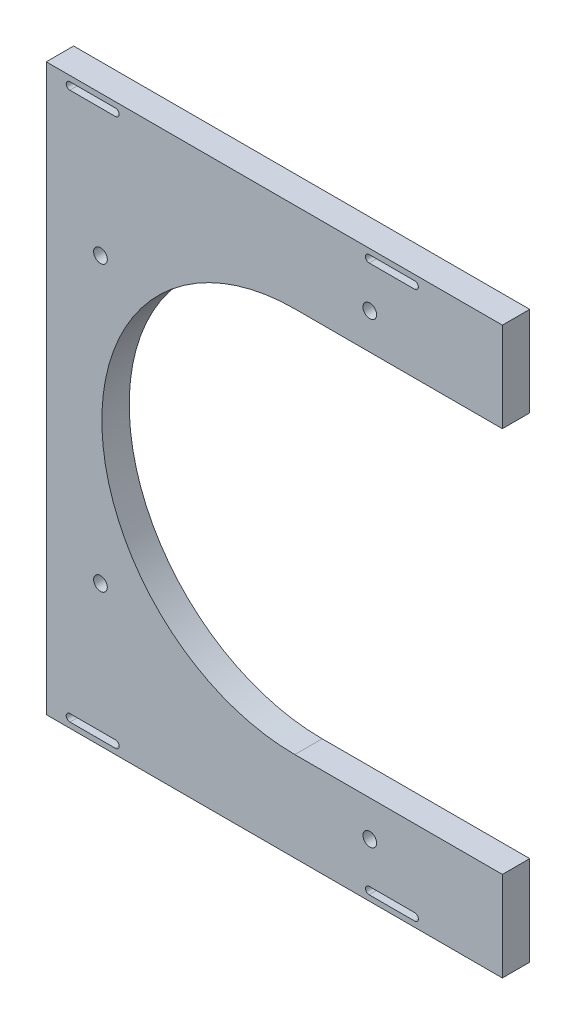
ISO-10303-21;
HEADER;
FILE_DESCRIPTION(('STEP AP214'),'2;1');
FILE_NAME('part.step','',(''),(''),'','','');
FILE_SCHEMA(('AUTOMOTIVE_DESIGN { 1 0 10303 214 1 1 1 1 }'));
ENDSEC;
DATA;
#1=APPLICATION_CONTEXT('core data for automotive mechanical design processes');
#2=APPLICATION_PROTOCOL_DEFINITION('international standard','automotive_design',2000,#1);
#3=PRODUCT_CONTEXT('',#1,'mechanical');
#4=PRODUCT('Part','Part','',(#3));
#5=PRODUCT_RELATED_PRODUCT_CATEGORY('part','',(#4));
#6=PRODUCT_DEFINITION_FORMATION('','',#4);
#7=PRODUCT_DEFINITION_CONTEXT('part definition',#1,'design');
#8=PRODUCT_DEFINITION('design','',#6,#7);
#9=PRODUCT_DEFINITION_SHAPE('','',#8);
#10=(LENGTH_UNIT() NAMED_UNIT(*) SI_UNIT(.MILLI.,.METRE.));
#11=(NAMED_UNIT(*) PLANE_ANGLE_UNIT() SI_UNIT($,.RADIAN.));
#12=(NAMED_UNIT(*) SI_UNIT($,.STERADIAN.) SOLID_ANGLE_UNIT());
#13=UNCERTAINTY_MEASURE_WITH_UNIT(LENGTH_MEASURE(1.E-05),#10,'distance_accuracy_value','');
#14=(GEOMETRIC_REPRESENTATION_CONTEXT(3) GLOBAL_UNCERTAINTY_ASSIGNED_CONTEXT((#13)) GLOBAL_UNIT_ASSIGNED_CONTEXT((#10,
#11,#12)) REPRESENTATION_CONTEXT('',''));
#15=CARTESIAN_POINT('',(0.,0.,0.));
#16=DIRECTION('',(0.,0.,1.));
#17=DIRECTION('',(1.,0.,0.));
#18=AXIS2_PLACEMENT_3D('',#15,#16,#17);
#19=CARTESIAN_POINT('',(518.073121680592,-159.302197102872,0.));
#20=DIRECTION('',(0.,0.,-1.));
#21=DIRECTION('',(0.,1.,0.));
#22=AXIS2_PLACEMENT_3D('',#19,#20,#21);
#23=CYLINDRICAL_SURFACE('',#22,4.7625);
#24=CARTESIAN_POINT('',(518.073121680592,-159.302197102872,19.05));
#25=DIRECTION('',(0.,0.,-1.));
#26=DIRECTION('',(0.,1.,0.));
#27=AXIS2_PLACEMENT_3D('',#24,#25,#26);
#28=CIRCLE('',#27,4.7625);
#29=CARTESIAN_POINT('',(518.073121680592,-154.539697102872,19.05));
#30=VERTEX_POINT('',#29);
#31=EDGE_CURVE('E421',#30,#30,#28,.T.);
#32=ORIENTED_EDGE('',*,*,#31,.F.);
#33=EDGE_LOOP('',(#32));
#34=FACE_BOUND('',#33,.T.);
#35=CARTESIAN_POINT('',(518.073121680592,-159.302197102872,9.52499999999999));
#36=DIRECTION('',(0.,0.,-1.));
#37=DIRECTION('',(-1.,0.,0.));
#38=AXIS2_PLACEMENT_3D('',#35,#36,#37);
#39=CIRCLE('',#38,4.7625);
#40=CARTESIAN_POINT('',(513.310621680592,-159.302197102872,9.52499999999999));
#41=VERTEX_POINT('',#40);
#42=EDGE_CURVE('E34',#41,#41,#39,.F.);
#43=ORIENTED_EDGE('',*,*,#42,.F.);
#44=EDGE_LOOP('',(#43));
#45=FACE_BOUND('',#44,.T.);
#46=ADVANCED_FACE('F30',(#34,#45),#23,.F.);
#47=CARTESIAN_POINT('',(330.526757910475,-98.8658581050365,0.));
#48=DIRECTION('',(0.,0.,-1.));
#49=DIRECTION('',(0.,1.,0.));
#50=AXIS2_PLACEMENT_3D('',#47,#48,#49);
#51=CYLINDRICAL_SURFACE('',#50,4.7625);
#52=CARTESIAN_POINT('',(330.526757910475,-98.8658581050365,19.05));
#53=DIRECTION('',(0.,0.,-1.));
#54=DIRECTION('',(0.,1.,0.));
#55=AXIS2_PLACEMENT_3D('',#52,#53,#54);
#56=CIRCLE('',#55,4.7625);
#57=CARTESIAN_POINT('',(330.526757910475,-94.1033581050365,19.05));
#58=VERTEX_POINT('',#57);
#59=EDGE_CURVE('E418',#58,#58,#56,.T.);
#60=ORIENTED_EDGE('',*,*,#59,.F.);
#61=EDGE_LOOP('',(#60));
#62=FACE_BOUND('',#61,.T.);
#63=CARTESIAN_POINT('',(330.526757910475,-98.8658581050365,9.52500000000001));
#64=DIRECTION('',(0.,0.,-1.));
#65=DIRECTION('',(-1.,0.,0.));
#66=AXIS2_PLACEMENT_3D('',#63,#64,#65);
#67=CIRCLE('',#66,4.7625);
#68=CARTESIAN_POINT('',(325.764257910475,-98.8658581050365,9.52500000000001));
#69=VERTEX_POINT('',#68);
#70=EDGE_CURVE('E390',#69,#69,#67,.F.);
#71=ORIENTED_EDGE('',*,*,#70,.F.);
#72=EDGE_LOOP('',(#71));
#73=FACE_BOUND('',#72,.T.);
#74=ADVANCED_FACE('F428',(#62,#73),#51,.F.);
#75=CARTESIAN_POINT('',(330.526757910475,98.8658581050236,0.));
#76=DIRECTION('',(0.,0.,-1.));
#77=DIRECTION('',(0.,1.,0.));
#78=AXIS2_PLACEMENT_3D('',#75,#76,#77);
#79=CYLINDRICAL_SURFACE('',#78,4.7625);
#80=CARTESIAN_POINT('',(330.526757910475,98.8658581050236,19.05));
#81=DIRECTION('',(0.,0.,-1.));
#82=DIRECTION('',(0.,1.,0.));
#83=AXIS2_PLACEMENT_3D('',#80,#81,#82);
#84=CIRCLE('',#83,4.7625);
#85=CARTESIAN_POINT('',(330.526757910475,103.628358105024,19.05));
#86=VERTEX_POINT('',#85);
#87=EDGE_CURVE('E415',#86,#86,#84,.T.);
#88=ORIENTED_EDGE('',*,*,#87,.F.);
#89=EDGE_LOOP('',(#88));
#90=FACE_BOUND('',#89,.T.);
#91=CARTESIAN_POINT('',(330.526757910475,98.8658581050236,9.52499999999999));
#92=DIRECTION('',(0.,0.,-1.));
#93=DIRECTION('',(-1.,0.,0.));
#94=AXIS2_PLACEMENT_3D('',#91,#92,#93);
#95=CIRCLE('',#94,4.7625);
#96=CARTESIAN_POINT('',(325.764257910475,98.8658581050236,9.52499999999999));
#97=VERTEX_POINT('',#96);
#98=EDGE_CURVE('E386',#97,#97,#95,.F.);
#99=ORIENTED_EDGE('',*,*,#98,.F.);
#100=EDGE_LOOP('',(#99));
#101=FACE_BOUND('',#100,.T.);
#102=ADVANCED_FACE('F585',(#90,#101),#79,.F.);
#103=CARTESIAN_POINT('',(518.073121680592,159.302197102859,0.));
#104=DIRECTION('',(0.,0.,-1.));
#105=DIRECTION('',(0.,1.,0.));
#106=AXIS2_PLACEMENT_3D('',#103,#104,#105);
#107=CYLINDRICAL_SURFACE('',#106,4.7625);
#108=CARTESIAN_POINT('',(518.073121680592,159.302197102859,19.05));
#109=DIRECTION('',(0.,0.,-1.));
#110=DIRECTION('',(0.,1.,0.));
#111=AXIS2_PLACEMENT_3D('',#108,#109,#110);
#112=CIRCLE('',#111,4.7625);
#113=CARTESIAN_POINT('',(518.073121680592,164.064697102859,19.05));
#114=VERTEX_POINT('',#113);
#115=EDGE_CURVE('E384',#114,#114,#112,.T.);
#116=ORIENTED_EDGE('',*,*,#115,.F.);
#117=EDGE_LOOP('',(#116));
#118=FACE_BOUND('',#117,.T.);
#119=CARTESIAN_POINT('',(518.073121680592,159.302197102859,9.52500000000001));
#120=DIRECTION('',(0.,0.,-1.));
#121=DIRECTION('',(-1.,0.,0.));
#122=AXIS2_PLACEMENT_3D('',#119,#120,#121);
#123=CIRCLE('',#122,4.7625);
#124=CARTESIAN_POINT('',(513.310621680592,159.302197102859,9.52500000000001));
#125=VERTEX_POINT('',#124);
#126=EDGE_CURVE('E381',#125,#125,#123,.F.);
#127=ORIENTED_EDGE('',*,*,#126,.F.);
#128=EDGE_LOOP('',(#127));
#129=FACE_BOUND('',#128,.T.);
#130=ADVANCED_FACE('F505',(#118,#129),#107,.F.);
#131=CARTESIAN_POINT('',(292.788864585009,196.849776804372,19.05));
#132=DIRECTION('',(0.,0.,1.));
#133=DIRECTION('',(1.,0.,0.));
#134=AXIS2_PLACEMENT_3D('',#131,#132,#133);
#135=PLANE('',#134);
#136=ORIENTED_EDGE('',*,*,#87,.T.);
#137=EDGE_LOOP('',(#136));
#138=FACE_BOUND('',#137,.T.);
#139=ORIENTED_EDGE('',*,*,#31,.T.);
#140=EDGE_LOOP('',(#139));
#141=FACE_BOUND('',#140,.T.);
#142=CARTESIAN_POINT('',(340.979627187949,-190.499776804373,19.05));
#143=DIRECTION('',(0.,0.,1.));
#144=DIRECTION('',(-1.,0.,0.));
#145=AXIS2_PLACEMENT_3D('',#142,#143,#144);
#146=CIRCLE('',#145,2.55270000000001);
#147=CARTESIAN_POINT('',(340.979627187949,-193.052476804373,19.05));
#148=VERTEX_POINT('',#147);
#149=CARTESIAN_POINT('',(340.979627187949,-187.947076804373,19.05));
#150=VERTEX_POINT('',#149);
#151=EDGE_CURVE('E47',#148,#150,#146,.T.);
#152=ORIENTED_EDGE('',*,*,#151,.F.);
#153=DIRECTION('',(1.,0.,0.));
#154=VECTOR('',#153,1.);
#155=CARTESIAN_POINT('',(340.979627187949,-193.052476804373,19.05));
#156=LINE('',#155,#154);
#157=CARTESIAN_POINT('',(309.229627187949,-193.052476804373,19.05));
#158=VERTEX_POINT('',#157);
#159=EDGE_CURVE('E211',#158,#148,#156,.T.);
#160=ORIENTED_EDGE('',*,*,#159,.F.);
#161=CARTESIAN_POINT('',(309.229627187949,-190.499776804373,19.05));
#162=DIRECTION('',(0.,0.,1.));
#163=DIRECTION('',(-1.,0.,0.));
#164=AXIS2_PLACEMENT_3D('',#161,#162,#163);
#165=CIRCLE('',#164,2.55270000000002);
#166=CARTESIAN_POINT('',(309.229627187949,-187.947076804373,19.05));
#167=VERTEX_POINT('',#166);
#168=EDGE_CURVE('E195',#167,#158,#165,.T.);
#169=ORIENTED_EDGE('',*,*,#168,.F.);
#170=DIRECTION('',(-1.,0.,0.));
#171=VECTOR('',#170,1.);
#172=CARTESIAN_POINT('',(340.979627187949,-187.947076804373,19.05));
#173=LINE('',#172,#171);
#174=EDGE_CURVE('E204',#150,#167,#173,.T.);
#175=ORIENTED_EDGE('',*,*,#174,.F.);
#176=EDGE_LOOP('',(#152,#160,#169,#175));
#177=FACE_BOUND('',#176,.T.);
#178=CARTESIAN_POINT('',(549.349353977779,-190.499776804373,19.05));
#179=DIRECTION('',(0.,0.,1.));
#180=DIRECTION('',(1.,0.,0.));
#181=AXIS2_PLACEMENT_3D('',#178,#179,#180);
#182=CIRCLE('',#181,2.55270000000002);
#183=CARTESIAN_POINT('',(549.349353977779,-193.052476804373,19.05));
#184=VERTEX_POINT('',#183);
#185=CARTESIAN_POINT('',(549.349353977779,-187.947076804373,19.05));
#186=VERTEX_POINT('',#185);
#187=EDGE_CURVE('E227',#184,#186,#182,.T.);
#188=ORIENTED_EDGE('',*,*,#187,.F.);
#189=DIRECTION('',(1.,0.,0.));
#190=VECTOR('',#189,1.);
#191=CARTESIAN_POINT('',(517.599353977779,-193.052476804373,19.05));
#192=LINE('',#191,#190);
#193=CARTESIAN_POINT('',(517.599353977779,-193.052476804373,19.05));
#194=VERTEX_POINT('',#193);
#195=EDGE_CURVE('E237',#194,#184,#192,.T.);
#196=ORIENTED_EDGE('',*,*,#195,.F.);
#197=CARTESIAN_POINT('',(517.599353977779,-190.499776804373,19.05));
#198=DIRECTION('',(0.,0.,1.));
#199=DIRECTION('',(1.,0.,0.));
#200=AXIS2_PLACEMENT_3D('',#197,#198,#199);
#201=CIRCLE('',#200,2.55270000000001);
#202=CARTESIAN_POINT('',(517.599353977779,-187.947076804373,19.05));
#203=VERTEX_POINT('',#202);
#204=EDGE_CURVE('E234',#203,#194,#201,.T.);
#205=ORIENTED_EDGE('',*,*,#204,.F.);
#206=DIRECTION('',(-1.,0.,0.));
#207=VECTOR('',#206,1.);
#208=CARTESIAN_POINT('',(517.599353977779,-187.947076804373,19.05));
#209=LINE('',#208,#207);
#210=EDGE_CURVE('E231',#186,#203,#209,.T.);
#211=ORIENTED_EDGE('',*,*,#210,.F.);
#212=EDGE_LOOP('',(#188,#196,#205,#211));
#213=FACE_BOUND('',#212,.T.);
#214=CARTESIAN_POINT('',(517.599353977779,190.499776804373,19.05));
#215=DIRECTION('',(0.,0.,1.));
#216=DIRECTION('',(-1.,0.,0.));
#217=AXIS2_PLACEMENT_3D('',#214,#215,#216);
#218=CIRCLE('',#217,2.55270000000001);
#219=CARTESIAN_POINT('',(517.599353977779,193.052476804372,19.05));
#220=VERTEX_POINT('',#219);
#221=CARTESIAN_POINT('',(517.599353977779,187.947076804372,19.05));
#222=VERTEX_POINT('',#221);
#223=EDGE_CURVE('E255',#220,#222,#218,.T.);
#224=ORIENTED_EDGE('',*,*,#223,.F.);
#225=DIRECTION('',(-1.,0.,0.));
#226=VECTOR('',#225,1.);
#227=CARTESIAN_POINT('',(517.599353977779,193.052476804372,19.05));
#228=LINE('',#227,#226);
#229=CARTESIAN_POINT('',(549.349353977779,193.052476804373,19.05));
#230=VERTEX_POINT('',#229);
#231=EDGE_CURVE('E269',#230,#220,#228,.T.);
#232=ORIENTED_EDGE('',*,*,#231,.F.);
#233=CARTESIAN_POINT('',(549.349353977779,190.499776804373,19.05));
#234=DIRECTION('',(0.,0.,1.));
#235=DIRECTION('',(-1.,0.,0.));
#236=AXIS2_PLACEMENT_3D('',#233,#234,#235);
#237=CIRCLE('',#236,2.55270000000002);
#238=CARTESIAN_POINT('',(549.349353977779,187.947076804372,19.05));
#239=VERTEX_POINT('',#238);
#240=EDGE_CURVE('E266',#239,#230,#237,.T.);
#241=ORIENTED_EDGE('',*,*,#240,.F.);
#242=DIRECTION('',(1.,0.,0.));
#243=VECTOR('',#242,1.);
#244=CARTESIAN_POINT('',(517.599353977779,187.947076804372,19.05));
#245=LINE('',#244,#243);
#246=EDGE_CURVE('E263',#222,#239,#245,.T.);
#247=ORIENTED_EDGE('',*,*,#246,.F.);
#248=EDGE_LOOP('',(#224,#232,#241,#247));
#249=FACE_BOUND('',#248,.T.);
#250=CARTESIAN_POINT('',(340.979627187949,190.499776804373,19.05));
#251=DIRECTION('',(0.,0.,1.));
#252=DIRECTION('',(1.,0.,0.));
#253=AXIS2_PLACEMENT_3D('',#250,#251,#252);
#254=CIRCLE('',#253,2.55270000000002);
#255=CARTESIAN_POINT('',(340.979627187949,187.947076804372,19.05));
#256=VERTEX_POINT('',#255);
#257=CARTESIAN_POINT('',(340.979627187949,193.052476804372,19.05));
#258=VERTEX_POINT('',#257);
#259=EDGE_CURVE('E287',#256,#258,#254,.T.);
#260=ORIENTED_EDGE('',*,*,#259,.F.);
#261=DIRECTION('',(1.,0.,0.));
#262=VECTOR('',#261,1.);
#263=CARTESIAN_POINT('',(340.979627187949,187.947076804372,19.05));
#264=LINE('',#263,#262);
#265=CARTESIAN_POINT('',(309.229627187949,187.947076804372,19.05));
#266=VERTEX_POINT('',#265);
#267=EDGE_CURVE('E301',#266,#256,#264,.T.);
#268=ORIENTED_EDGE('',*,*,#267,.F.);
#269=CARTESIAN_POINT('',(309.229627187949,190.499776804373,19.05));
#270=DIRECTION('',(0.,0.,1.));
#271=DIRECTION('',(1.,0.,0.));
#272=AXIS2_PLACEMENT_3D('',#269,#270,#271);
#273=CIRCLE('',#272,2.55270000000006);
#274=CARTESIAN_POINT('',(309.229627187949,193.052476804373,19.05));
#275=VERTEX_POINT('',#274);
#276=EDGE_CURVE('E298',#275,#266,#273,.T.);
#277=ORIENTED_EDGE('',*,*,#276,.F.);
#278=DIRECTION('',(-1.,0.,0.));
#279=VECTOR('',#278,1.);
#280=CARTESIAN_POINT('',(340.979627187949,193.052476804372,19.05));
#281=LINE('',#280,#279);
#282=EDGE_CURVE('E295',#258,#275,#281,.T.);
#283=ORIENTED_EDGE('',*,*,#282,.F.);
#284=EDGE_LOOP('',(#260,#268,#277,#283));
#285=FACE_BOUND('',#284,.T.);
#286=DIRECTION('',(-1.,0.,0.));
#287=VECTOR('',#286,1.);
#288=CARTESIAN_POINT('',(610.388207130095,134.373349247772,19.05));
#289=LINE('',#288,#287);
#290=CARTESIAN_POINT('',(610.388207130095,134.373349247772,19.05));
#291=VERTEX_POINT('',#290);
#292=CARTESIAN_POINT('',(465.862207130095,134.373349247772,19.05));
#293=VERTEX_POINT('',#292);
#294=EDGE_CURVE('E330',#291,#293,#289,.T.);
#295=ORIENTED_EDGE('',*,*,#294,.F.);
#296=DIRECTION('',(0.,1.,0.));
#297=VECTOR('',#296,1.);
#298=CARTESIAN_POINT('',(610.388207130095,-196.849776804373,19.05));
#299=LINE('',#298,#297);
#300=CARTESIAN_POINT('',(610.388207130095,196.849776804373,19.05));
#301=VERTEX_POINT('',#300);
#302=EDGE_CURVE('E367',#291,#301,#299,.T.);
#303=ORIENTED_EDGE('',*,*,#302,.T.);
#304=DIRECTION('',(-1.,0.,0.));
#305=VECTOR('',#304,1.);
#306=CARTESIAN_POINT('',(610.388207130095,196.849776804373,19.05));
#307=LINE('',#306,#305);
#308=CARTESIAN_POINT('',(292.788864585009,196.849776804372,19.05));
#309=VERTEX_POINT('',#308);
#310=EDGE_CURVE('E371',#301,#309,#307,.T.);
#311=ORIENTED_EDGE('',*,*,#310,.T.);
#312=DIRECTION('',(0.,-1.,0.));
#313=VECTOR('',#312,1.);
#314=CARTESIAN_POINT('',(292.788864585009,-196.849776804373,19.05));
#315=LINE('',#314,#313);
#316=CARTESIAN_POINT('',(292.788864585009,-196.849776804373,19.05));
#317=VERTEX_POINT('',#316);
#318=EDGE_CURVE('E362',#309,#317,#315,.T.);
#319=ORIENTED_EDGE('',*,*,#318,.T.);
#320=DIRECTION('',(1.,0.,0.));
#321=VECTOR('',#320,1.);
#322=CARTESIAN_POINT('',(292.788864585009,-196.849776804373,19.05));
#323=LINE('',#322,#321);
#324=CARTESIAN_POINT('',(610.388207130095,-196.849776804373,19.05));
#325=VERTEX_POINT('',#324);
#326=EDGE_CURVE('E365',#317,#325,#323,.T.);
#327=ORIENTED_EDGE('',*,*,#326,.T.);
#328=CARTESIAN_POINT('',(610.388207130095,-134.373349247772,19.05));
#329=VERTEX_POINT('',#328);
#330=EDGE_CURVE('E368',#325,#329,#299,.T.);
#331=ORIENTED_EDGE('',*,*,#330,.T.);
#332=DIRECTION('',(1.,0.,0.));
#333=VECTOR('',#332,1.);
#334=CARTESIAN_POINT('',(610.388207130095,-134.373349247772,19.05));
#335=LINE('',#334,#333);
#336=CARTESIAN_POINT('',(465.862207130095,-134.373349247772,19.05));
#337=VERTEX_POINT('',#336);
#338=EDGE_CURVE('E328',#337,#329,#335,.T.);
#339=ORIENTED_EDGE('',*,*,#338,.F.);
#340=CARTESIAN_POINT('',(465.862207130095,0.,19.05));
#341=DIRECTION('',(0.,0.,1.));
#342=DIRECTION('',(1.,0.,0.));
#343=AXIS2_PLACEMENT_3D('',#340,#341,#342);
#344=CIRCLE('',#343,134.373349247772);
#345=EDGE_CURVE('E319',#293,#337,#344,.T.);
#346=ORIENTED_EDGE('',*,*,#345,.F.);
#347=EDGE_LOOP('',(#295,#303,#311,#319,#327,#331,#339,#346));
#348=FACE_BOUND('',#347,.T.);
#349=ORIENTED_EDGE('',*,*,#59,.T.);
#350=EDGE_LOOP('',(#349));
#351=FACE_BOUND('',#350,.T.);
#352=ORIENTED_EDGE('',*,*,#115,.T.);
#353=EDGE_LOOP('',(#352));
#354=FACE_BOUND('',#353,.T.);
#355=ADVANCED_FACE('F208',(#138,#141,#177,#213,#249,#285,#348,#351,#354),#135,.T.);
#356=CARTESIAN_POINT('',(610.388207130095,-196.849776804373,19.05));
#357=DIRECTION('',(-1.,0.,0.));
#358=DIRECTION('',(0.,0.,1.));
#359=AXIS2_PLACEMENT_3D('',#356,#357,#358);
#360=PLANE('',#359);
#361=ORIENTED_EDGE('',*,*,#302,.F.);
#362=DIRECTION('',(0.,0.,1.));
#363=VECTOR('',#362,1.);
#364=CARTESIAN_POINT('',(610.388207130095,134.373349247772,0.));
#365=LINE('',#364,#363);
#366=CARTESIAN_POINT('',(610.388207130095,134.373349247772,0.));
#367=VERTEX_POINT('',#366);
#368=EDGE_CURVE('E346',#367,#291,#365,.T.);
#369=ORIENTED_EDGE('',*,*,#368,.F.);
#370=DIRECTION('',(0.,1.,0.));
#371=VECTOR('',#370,1.);
#372=CARTESIAN_POINT('',(610.388207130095,-196.849776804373,0.));
#373=LINE('',#372,#371);
#374=CARTESIAN_POINT('',(610.388207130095,196.849776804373,0.));
#375=VERTEX_POINT('',#374);
#376=EDGE_CURVE('E356',#367,#375,#373,.T.);
#377=ORIENTED_EDGE('',*,*,#376,.T.);
#378=DIRECTION('',(0.,0.,-1.));
#379=VECTOR('',#378,1.);
#380=CARTESIAN_POINT('',(610.388207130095,196.849776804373,19.05));
#381=LINE('',#380,#379);
#382=EDGE_CURVE('E376',#301,#375,#381,.T.);
#383=ORIENTED_EDGE('',*,*,#382,.F.);
#384=EDGE_LOOP('',(#361,#369,#377,#383));
#385=FACE_BOUND('',#384,.T.);
#386=ADVANCED_FACE('F471',(#385),#360,.F.);
#387=CARTESIAN_POINT('',(292.788864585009,-196.849776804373,19.05));
#388=DIRECTION('',(1.,0.,0.));
#389=DIRECTION('',(0.,0.,-1.));
#390=AXIS2_PLACEMENT_3D('',#387,#388,#389);
#391=PLANE('',#390);
#392=DIRECTION('',(0.,-1.,0.));
#393=VECTOR('',#392,1.);
#394=CARTESIAN_POINT('',(292.788864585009,-196.849776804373,0.));
#395=LINE('',#394,#393);
#396=CARTESIAN_POINT('',(292.788864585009,196.849776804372,0.));
#397=VERTEX_POINT('',#396);
#398=CARTESIAN_POINT('',(292.788864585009,-196.849776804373,0.));
#399=VERTEX_POINT('',#398);
#400=EDGE_CURVE('E345',#397,#399,#395,.T.);
#401=ORIENTED_EDGE('',*,*,#400,.T.);
#402=DIRECTION('',(0.,0.,-1.));
#403=VECTOR('',#402,1.);
#404=CARTESIAN_POINT('',(292.788864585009,-196.849776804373,19.05));
#405=LINE('',#404,#403);
#406=EDGE_CURVE('E11',#317,#399,#405,.T.);
#407=ORIENTED_EDGE('',*,*,#406,.F.);
#408=ORIENTED_EDGE('',*,*,#318,.F.);
#409=DIRECTION('',(0.,0.,-1.));
#410=VECTOR('',#409,1.);
#411=CARTESIAN_POINT('',(292.788864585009,196.849776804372,19.05));
#412=LINE('',#411,#410);
#413=EDGE_CURVE('E373',#309,#397,#412,.T.);
#414=ORIENTED_EDGE('',*,*,#413,.T.);
#415=EDGE_LOOP('',(#401,#407,#408,#414));
#416=FACE_BOUND('',#415,.T.);
#417=ADVANCED_FACE('F32',(#416),#391,.F.);
#418=CARTESIAN_POINT('',(292.788864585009,-196.849776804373,19.05));
#419=DIRECTION('',(0.,1.,0.));
#420=DIRECTION('',(0.,0.,1.));
#421=AXIS2_PLACEMENT_3D('',#418,#419,#420);
#422=PLANE('',#421);
#423=DIRECTION('',(1.,0.,0.));
#424=VECTOR('',#423,1.);
#425=CARTESIAN_POINT('',(292.788864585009,-196.849776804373,0.));
#426=LINE('',#425,#424);
#427=CARTESIAN_POINT('',(610.388207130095,-196.849776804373,0.));
#428=VERTEX_POINT('',#427);
#429=EDGE_CURVE('E354',#399,#428,#426,.T.);
#430=ORIENTED_EDGE('',*,*,#429,.T.);
#431=DIRECTION('',(0.,0.,-1.));
#432=VECTOR('',#431,1.);
#433=CARTESIAN_POINT('',(610.388207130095,-196.849776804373,19.05));
#434=LINE('',#433,#432);
#435=EDGE_CURVE('E39',#325,#428,#434,.T.);
#436=ORIENTED_EDGE('',*,*,#435,.F.);
#437=ORIENTED_EDGE('',*,*,#326,.F.);
#438=ORIENTED_EDGE('',*,*,#406,.T.);
#439=EDGE_LOOP('',(#430,#436,#437,#438));
#440=FACE_BOUND('',#439,.T.);
#441=ADVANCED_FACE('F494',(#440),#422,.F.);
#442=CARTESIAN_POINT('',(610.388207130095,-134.373349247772,0.));
#443=VERTEX_POINT('',#442);
#444=EDGE_CURVE('E357',#428,#443,#373,.T.);
#445=ORIENTED_EDGE('',*,*,#444,.T.);
#446=DIRECTION('',(0.,0.,1.));
#447=VECTOR('',#446,1.);
#448=CARTESIAN_POINT('',(610.388207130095,-134.373349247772,0.));
#449=LINE('',#448,#447);
#450=EDGE_CURVE('E348',#443,#329,#449,.T.);
#451=ORIENTED_EDGE('',*,*,#450,.T.);
#452=ORIENTED_EDGE('',*,*,#330,.F.);
#453=ORIENTED_EDGE('',*,*,#435,.T.);
#454=EDGE_LOOP('',(#445,#451,#452,#453));
#455=FACE_BOUND('',#454,.T.);
#456=ADVANCED_FACE('F490',(#455),#360,.F.);
#457=CARTESIAN_POINT('',(610.388207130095,196.849776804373,19.05));
#458=DIRECTION('',(0.,-1.,0.));
#459=DIRECTION('',(0.,0.,-1.));
#460=AXIS2_PLACEMENT_3D('',#457,#458,#459);
#461=PLANE('',#460);
#462=DIRECTION('',(-1.,0.,0.));
#463=VECTOR('',#462,1.);
#464=CARTESIAN_POINT('',(610.388207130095,196.849776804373,0.));
#465=LINE('',#464,#463);
#466=EDGE_CURVE('E360',#375,#397,#465,.T.);
#467=ORIENTED_EDGE('',*,*,#466,.T.);
#468=ORIENTED_EDGE('',*,*,#413,.F.);
#469=ORIENTED_EDGE('',*,*,#310,.F.);
#470=ORIENTED_EDGE('',*,*,#382,.T.);
#471=EDGE_LOOP('',(#467,#468,#469,#470));
#472=FACE_BOUND('',#471,.T.);
#473=ADVANCED_FACE('F448',(#472),#461,.F.);
#474=CARTESIAN_POINT('',(292.788864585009,196.849776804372,0.));
#475=DIRECTION('',(0.,0.,1.));
#476=DIRECTION('',(1.,0.,0.));
#477=AXIS2_PLACEMENT_3D('',#474,#475,#476);
#478=PLANE('',#477);
#479=CARTESIAN_POINT('',(518.073121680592,-159.302197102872,0.));
#480=DIRECTION('',(0.,0.,-1.));
#481=DIRECTION('',(-1.,0.,0.));
#482=AXIS2_PLACEMENT_3D('',#479,#480,#481);
#483=CIRCLE('',#482,11.1125);
#484=CARTESIAN_POINT('',(506.960621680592,-159.302197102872,0.));
#485=VERTEX_POINT('',#484);
#486=EDGE_CURVE('E435',#485,#485,#483,.T.);
#487=ORIENTED_EDGE('',*,*,#486,.F.);
#488=EDGE_LOOP('',(#487));
#489=FACE_BOUND('',#488,.T.);
#490=CARTESIAN_POINT('',(330.526757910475,-98.8658581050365,0.));
#491=DIRECTION('',(0.,0.,-1.));
#492=DIRECTION('',(-1.,0.,0.));
#493=AXIS2_PLACEMENT_3D('',#490,#491,#492);
#494=CIRCLE('',#493,11.1125);
#495=CARTESIAN_POINT('',(319.414257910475,-98.8658581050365,0.));
#496=VERTEX_POINT('',#495);
#497=EDGE_CURVE('E399',#496,#496,#494,.T.);
#498=ORIENTED_EDGE('',*,*,#497,.F.);
#499=EDGE_LOOP('',(#498));
#500=FACE_BOUND('',#499,.T.);
#501=CARTESIAN_POINT('',(330.526757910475,98.8658581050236,0.));
#502=DIRECTION('',(0.,0.,-1.));
#503=DIRECTION('',(-1.,0.,0.));
#504=AXIS2_PLACEMENT_3D('',#501,#502,#503);
#505=CIRCLE('',#504,11.1125);
#506=CARTESIAN_POINT('',(319.414257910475,98.8658581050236,0.));
#507=VERTEX_POINT('',#506);
#508=EDGE_CURVE('E392',#507,#507,#505,.T.);
#509=ORIENTED_EDGE('',*,*,#508,.F.);
#510=EDGE_LOOP('',(#509));
#511=FACE_BOUND('',#510,.T.);
#512=CARTESIAN_POINT('',(518.073121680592,159.302197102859,0.));
#513=DIRECTION('',(0.,0.,-1.));
#514=DIRECTION('',(-1.,0.,0.));
#515=AXIS2_PLACEMENT_3D('',#512,#513,#514);
#516=CIRCLE('',#515,11.1125);
#517=CARTESIAN_POINT('',(506.960621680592,159.302197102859,0.));
#518=VERTEX_POINT('',#517);
#519=EDGE_CURVE('E388',#518,#518,#516,.T.);
#520=ORIENTED_EDGE('',*,*,#519,.F.);
#521=EDGE_LOOP('',(#520));
#522=FACE_BOUND('',#521,.T.);
#523=DIRECTION('',(1.,0.,0.));
#524=VECTOR('',#523,1.);
#525=CARTESIAN_POINT('',(340.979627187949,-193.052476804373,0.));
#526=LINE('',#525,#524);
#527=CARTESIAN_POINT('',(309.229627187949,-193.052476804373,0.));
#528=VERTEX_POINT('',#527);
#529=CARTESIAN_POINT('',(340.979627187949,-193.052476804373,0.));
#530=VERTEX_POINT('',#529);
#531=EDGE_CURVE('E222',#528,#530,#526,.T.);
#532=ORIENTED_EDGE('',*,*,#531,.T.);
#533=CARTESIAN_POINT('',(340.979627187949,-190.499776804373,0.));
#534=DIRECTION('',(0.,0.,1.));
#535=DIRECTION('',(-1.,0.,0.));
#536=AXIS2_PLACEMENT_3D('',#533,#534,#535);
#537=CIRCLE('',#536,2.55270000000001);
#538=CARTESIAN_POINT('',(340.979627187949,-187.947076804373,0.));
#539=VERTEX_POINT('',#538);
#540=EDGE_CURVE('E213',#530,#539,#537,.T.);
#541=ORIENTED_EDGE('',*,*,#540,.T.);
#542=DIRECTION('',(-1.,0.,0.));
#543=VECTOR('',#542,1.);
#544=CARTESIAN_POINT('',(340.979627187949,-187.947076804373,0.));
#545=LINE('',#544,#543);
#546=CARTESIAN_POINT('',(309.229627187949,-187.947076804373,0.));
#547=VERTEX_POINT('',#546);
#548=EDGE_CURVE('E219',#539,#547,#545,.T.);
#549=ORIENTED_EDGE('',*,*,#548,.T.);
#550=CARTESIAN_POINT('',(309.229627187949,-190.499776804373,0.));
#551=DIRECTION('',(0.,0.,1.));
#552=DIRECTION('',(-1.,0.,0.));
#553=AXIS2_PLACEMENT_3D('',#550,#551,#552);
#554=CIRCLE('',#553,2.55270000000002);
#555=EDGE_CURVE('E55',#547,#528,#554,.T.);
#556=ORIENTED_EDGE('',*,*,#555,.T.);
#557=EDGE_LOOP('',(#532,#541,#549,#556));
#558=FACE_BOUND('',#557,.T.);
#559=DIRECTION('',(1.,0.,0.));
#560=VECTOR('',#559,1.);
#561=CARTESIAN_POINT('',(517.599353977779,-193.052476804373,0.));
#562=LINE('',#561,#560);
#563=CARTESIAN_POINT('',(517.599353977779,-193.052476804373,0.));
#564=VERTEX_POINT('',#563);
#565=CARTESIAN_POINT('',(549.349353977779,-193.052476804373,0.));
#566=VERTEX_POINT('',#565);
#567=EDGE_CURVE('E249',#564,#566,#562,.T.);
#568=ORIENTED_EDGE('',*,*,#567,.T.);
#569=CARTESIAN_POINT('',(549.349353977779,-190.499776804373,0.));
#570=DIRECTION('',(0.,0.,1.));
#571=DIRECTION('',(1.,0.,0.));
#572=AXIS2_PLACEMENT_3D('',#569,#570,#571);
#573=CIRCLE('',#572,2.55270000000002);
#574=CARTESIAN_POINT('',(549.349353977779,-187.947076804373,0.));
#575=VERTEX_POINT('',#574);
#576=EDGE_CURVE('E240',#566,#575,#573,.T.);
#577=ORIENTED_EDGE('',*,*,#576,.T.);
#578=DIRECTION('',(-1.,0.,0.));
#579=VECTOR('',#578,1.);
#580=CARTESIAN_POINT('',(517.599353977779,-187.947076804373,0.));
#581=LINE('',#580,#579);
#582=CARTESIAN_POINT('',(517.599353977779,-187.947076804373,0.));
#583=VERTEX_POINT('',#582);
#584=EDGE_CURVE('E243',#575,#583,#581,.T.);
#585=ORIENTED_EDGE('',*,*,#584,.T.);
#586=CARTESIAN_POINT('',(517.599353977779,-190.499776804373,0.));
#587=DIRECTION('',(0.,0.,1.));
#588=DIRECTION('',(1.,0.,0.));
#589=AXIS2_PLACEMENT_3D('',#586,#587,#588);
#590=CIRCLE('',#589,2.55270000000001);
#591=EDGE_CURVE('E246',#583,#564,#590,.T.);
#592=ORIENTED_EDGE('',*,*,#591,.T.);
#593=EDGE_LOOP('',(#568,#577,#585,#592));
#594=FACE_BOUND('',#593,.T.);
#595=DIRECTION('',(-1.,0.,0.));
#596=VECTOR('',#595,1.);
#597=CARTESIAN_POINT('',(517.599353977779,193.052476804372,0.));
#598=LINE('',#597,#596);
#599=CARTESIAN_POINT('',(549.349353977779,193.052476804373,0.));
#600=VERTEX_POINT('',#599);
#601=CARTESIAN_POINT('',(517.599353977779,193.052476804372,0.));
#602=VERTEX_POINT('',#601);
#603=EDGE_CURVE('E281',#600,#602,#598,.T.);
#604=ORIENTED_EDGE('',*,*,#603,.T.);
#605=CARTESIAN_POINT('',(517.599353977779,190.499776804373,0.));
#606=DIRECTION('',(0.,0.,1.));
#607=DIRECTION('',(-1.,0.,0.));
#608=AXIS2_PLACEMENT_3D('',#605,#606,#607);
#609=CIRCLE('',#608,2.55270000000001);
#610=CARTESIAN_POINT('',(517.599353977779,187.947076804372,0.));
#611=VERTEX_POINT('',#610);
#612=EDGE_CURVE('E272',#602,#611,#609,.T.);
#613=ORIENTED_EDGE('',*,*,#612,.T.);
#614=DIRECTION('',(1.,0.,0.));
#615=VECTOR('',#614,1.);
#616=CARTESIAN_POINT('',(517.599353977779,187.947076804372,0.));
#617=LINE('',#616,#615);
#618=CARTESIAN_POINT('',(549.349353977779,187.947076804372,0.));
#619=VERTEX_POINT('',#618);
#620=EDGE_CURVE('E275',#611,#619,#617,.T.);
#621=ORIENTED_EDGE('',*,*,#620,.T.);
#622=CARTESIAN_POINT('',(549.349353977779,190.499776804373,0.));
#623=DIRECTION('',(0.,0.,1.));
#624=DIRECTION('',(-1.,0.,0.));
#625=AXIS2_PLACEMENT_3D('',#622,#623,#624);
#626=CIRCLE('',#625,2.55270000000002);
#627=EDGE_CURVE('E278',#619,#600,#626,.T.);
#628=ORIENTED_EDGE('',*,*,#627,.T.);
#629=EDGE_LOOP('',(#604,#613,#621,#628));
#630=FACE_BOUND('',#629,.T.);
#631=DIRECTION('',(1.,0.,0.));
#632=VECTOR('',#631,1.);
#633=CARTESIAN_POINT('',(340.979627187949,187.947076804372,0.));
#634=LINE('',#633,#632);
#635=CARTESIAN_POINT('',(309.229627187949,187.947076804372,0.));
#636=VERTEX_POINT('',#635);
#637=CARTESIAN_POINT('',(340.979627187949,187.947076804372,0.));
#638=VERTEX_POINT('',#637);
#639=EDGE_CURVE('E313',#636,#638,#634,.T.);
#640=ORIENTED_EDGE('',*,*,#639,.T.);
#641=CARTESIAN_POINT('',(340.979627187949,190.499776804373,0.));
#642=DIRECTION('',(0.,0.,1.));
#643=DIRECTION('',(1.,0.,0.));
#644=AXIS2_PLACEMENT_3D('',#641,#642,#643);
#645=CIRCLE('',#644,2.55270000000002);
#646=CARTESIAN_POINT('',(340.979627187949,193.052476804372,0.));
#647=VERTEX_POINT('',#646);
#648=EDGE_CURVE('E304',#638,#647,#645,.T.);
#649=ORIENTED_EDGE('',*,*,#648,.T.);
#650=DIRECTION('',(-1.,0.,0.));
#651=VECTOR('',#650,1.);
#652=CARTESIAN_POINT('',(340.979627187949,193.052476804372,0.));
#653=LINE('',#652,#651);
#654=CARTESIAN_POINT('',(309.229627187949,193.052476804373,0.));
#655=VERTEX_POINT('',#654);
#656=EDGE_CURVE('E307',#647,#655,#653,.T.);
#657=ORIENTED_EDGE('',*,*,#656,.T.);
#658=CARTESIAN_POINT('',(309.229627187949,190.499776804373,0.));
#659=DIRECTION('',(0.,0.,1.));
#660=DIRECTION('',(1.,0.,0.));
#661=AXIS2_PLACEMENT_3D('',#658,#659,#660);
#662=CIRCLE('',#661,2.55270000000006);
#663=EDGE_CURVE('E310',#655,#636,#662,.T.);
#664=ORIENTED_EDGE('',*,*,#663,.T.);
#665=EDGE_LOOP('',(#640,#649,#657,#664));
#666=FACE_BOUND('',#665,.T.);
#667=ORIENTED_EDGE('',*,*,#376,.F.);
#668=DIRECTION('',(-1.,0.,0.));
#669=VECTOR('',#668,1.);
#670=CARTESIAN_POINT('',(610.388207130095,134.373349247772,0.));
#671=LINE('',#670,#669);
#672=CARTESIAN_POINT('',(465.862207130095,134.373349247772,0.));
#673=VERTEX_POINT('',#672);
#674=EDGE_CURVE('E339',#367,#673,#671,.T.);
#675=ORIENTED_EDGE('',*,*,#674,.T.);
#676=CARTESIAN_POINT('',(465.862207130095,0.,0.));
#677=DIRECTION('',(0.,0.,1.));
#678=DIRECTION('',(1.,0.,0.));
#679=AXIS2_PLACEMENT_3D('',#676,#677,#678);
#680=CIRCLE('',#679,134.373349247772);
#681=CARTESIAN_POINT('',(465.862207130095,-134.373349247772,0.));
#682=VERTEX_POINT('',#681);
#683=EDGE_CURVE('E333',#673,#682,#680,.T.);
#684=ORIENTED_EDGE('',*,*,#683,.T.);
#685=DIRECTION('',(1.,0.,0.));
#686=VECTOR('',#685,1.);
#687=CARTESIAN_POINT('',(610.388207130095,-134.373349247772,0.));
#688=LINE('',#687,#686);
#689=EDGE_CURVE('E336',#682,#443,#688,.T.);
#690=ORIENTED_EDGE('',*,*,#689,.T.);
#691=ORIENTED_EDGE('',*,*,#444,.F.);
#692=ORIENTED_EDGE('',*,*,#429,.F.);
#693=ORIENTED_EDGE('',*,*,#400,.F.);
#694=ORIENTED_EDGE('',*,*,#466,.F.);
#695=EDGE_LOOP('',(#667,#675,#684,#690,#691,#692,#693,#694));
#696=FACE_BOUND('',#695,.T.);
#697=ADVANCED_FACE('F444',(#489,#500,#511,#522,#558,#594,#630,#666,#696),#478,.F.);
#698=CARTESIAN_POINT('',(465.862207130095,0.,0.));
#699=DIRECTION('',(0.,0.,1.));
#700=DIRECTION('',(1.,0.,0.));
#701=AXIS2_PLACEMENT_3D('',#698,#699,#700);
#702=CYLINDRICAL_SURFACE('',#701,134.373349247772);
#703=ORIENTED_EDGE('',*,*,#345,.T.);
#704=DIRECTION('',(0.,0.,1.));
#705=VECTOR('',#704,1.);
#706=CARTESIAN_POINT('',(465.862207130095,-134.373349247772,0.));
#707=LINE('',#706,#705);
#708=EDGE_CURVE('E342',#682,#337,#707,.T.);
#709=ORIENTED_EDGE('',*,*,#708,.F.);
#710=ORIENTED_EDGE('',*,*,#683,.F.);
#711=DIRECTION('',(0.,0.,1.));
#712=VECTOR('',#711,1.);
#713=CARTESIAN_POINT('',(465.862207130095,134.373349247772,0.));
#714=LINE('',#713,#712);
#715=EDGE_CURVE('E343',#673,#293,#714,.T.);
#716=ORIENTED_EDGE('',*,*,#715,.T.);
#717=EDGE_LOOP('',(#703,#709,#710,#716));
#718=FACE_BOUND('',#717,.T.);
#719=ADVANCED_FACE('F447',(#718),#702,.F.);
#720=CARTESIAN_POINT('',(610.388207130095,134.373349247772,0.));
#721=DIRECTION('',(0.,1.,0.));
#722=DIRECTION('',(0.,0.,1.));
#723=AXIS2_PLACEMENT_3D('',#720,#721,#722);
#724=PLANE('',#723);
#725=ORIENTED_EDGE('',*,*,#294,.T.);
#726=ORIENTED_EDGE('',*,*,#715,.F.);
#727=ORIENTED_EDGE('',*,*,#674,.F.);
#728=ORIENTED_EDGE('',*,*,#368,.T.);
#729=EDGE_LOOP('',(#725,#726,#727,#728));
#730=FACE_BOUND('',#729,.T.);
#731=ADVANCED_FACE('F483',(#730),#724,.F.);
#732=CARTESIAN_POINT('',(610.388207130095,-134.373349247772,0.));
#733=DIRECTION('',(0.,-1.,0.));
#734=DIRECTION('',(0.,0.,-1.));
#735=AXIS2_PLACEMENT_3D('',#732,#733,#734);
#736=PLANE('',#735);
#737=ORIENTED_EDGE('',*,*,#338,.T.);
#738=ORIENTED_EDGE('',*,*,#450,.F.);
#739=ORIENTED_EDGE('',*,*,#689,.F.);
#740=ORIENTED_EDGE('',*,*,#708,.T.);
#741=EDGE_LOOP('',(#737,#738,#739,#740));
#742=FACE_BOUND('',#741,.T.);
#743=ADVANCED_FACE('F518',(#742),#736,.F.);
#744=CARTESIAN_POINT('',(340.979627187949,190.499776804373,0.));
#745=DIRECTION('',(0.,0.,1.));
#746=DIRECTION('',(1.,0.,0.));
#747=AXIS2_PLACEMENT_3D('',#744,#745,#746);
#748=CYLINDRICAL_SURFACE('',#747,2.55270000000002);
#749=ORIENTED_EDGE('',*,*,#259,.T.);
#750=DIRECTION('',(0.,0.,1.));
#751=VECTOR('',#750,1.);
#752=CARTESIAN_POINT('',(340.979627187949,193.052476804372,0.));
#753=LINE('',#752,#751);
#754=EDGE_CURVE('E316',#647,#258,#753,.T.);
#755=ORIENTED_EDGE('',*,*,#754,.F.);
#756=ORIENTED_EDGE('',*,*,#648,.F.);
#757=DIRECTION('',(0.,0.,1.));
#758=VECTOR('',#757,1.);
#759=CARTESIAN_POINT('',(340.979627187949,187.947076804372,0.));
#760=LINE('',#759,#758);
#761=EDGE_CURVE('E317',#638,#256,#760,.T.);
#762=ORIENTED_EDGE('',*,*,#761,.T.);
#763=EDGE_LOOP('',(#749,#755,#756,#762));
#764=FACE_BOUND('',#763,.T.);
#765=ADVANCED_FACE('F521',(#764),#748,.F.);
#766=CARTESIAN_POINT('',(340.979627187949,187.947076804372,0.));
#767=DIRECTION('',(0.,-1.,0.));
#768=DIRECTION('',(1.,0.,0.));
#769=AXIS2_PLACEMENT_3D('',#766,#767,#768);
#770=PLANE('',#769);
#771=ORIENTED_EDGE('',*,*,#267,.T.);
#772=ORIENTED_EDGE('',*,*,#761,.F.);
#773=ORIENTED_EDGE('',*,*,#639,.F.);
#774=DIRECTION('',(0.,0.,1.));
#775=VECTOR('',#774,1.);
#776=CARTESIAN_POINT('',(309.229627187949,187.947076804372,0.));
#777=LINE('',#776,#775);
#778=EDGE_CURVE('E320',#636,#266,#777,.T.);
#779=ORIENTED_EDGE('',*,*,#778,.T.);
#780=EDGE_LOOP('',(#771,#772,#773,#779));
#781=FACE_BOUND('',#780,.T.);
#782=ADVANCED_FACE('F526',(#781),#770,.F.);
#783=CARTESIAN_POINT('',(309.229627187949,190.499776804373,0.));
#784=DIRECTION('',(0.,0.,1.));
#785=DIRECTION('',(1.,0.,0.));
#786=AXIS2_PLACEMENT_3D('',#783,#784,#785);
#787=CYLINDRICAL_SURFACE('',#786,2.55270000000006);
#788=ORIENTED_EDGE('',*,*,#276,.T.);
#789=ORIENTED_EDGE('',*,*,#778,.F.);
#790=ORIENTED_EDGE('',*,*,#663,.F.);
#791=DIRECTION('',(0.,0.,1.));
#792=VECTOR('',#791,1.);
#793=CARTESIAN_POINT('',(309.229627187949,193.052476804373,0.));
#794=LINE('',#793,#792);
#795=EDGE_CURVE('E322',#655,#275,#794,.T.);
#796=ORIENTED_EDGE('',*,*,#795,.T.);
#797=EDGE_LOOP('',(#788,#789,#790,#796));
#798=FACE_BOUND('',#797,.T.);
#799=ADVANCED_FACE('F532',(#798),#787,.F.);
#800=CARTESIAN_POINT('',(340.979627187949,193.052476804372,0.));
#801=DIRECTION('',(0.,1.,0.));
#802=DIRECTION('',(-1.,0.,0.));
#803=AXIS2_PLACEMENT_3D('',#800,#801,#802);
#804=PLANE('',#803);
#805=ORIENTED_EDGE('',*,*,#282,.T.);
#806=ORIENTED_EDGE('',*,*,#795,.F.);
#807=ORIENTED_EDGE('',*,*,#656,.F.);
#808=ORIENTED_EDGE('',*,*,#754,.T.);
#809=EDGE_LOOP('',(#805,#806,#807,#808));
#810=FACE_BOUND('',#809,.T.);
#811=ADVANCED_FACE('F528',(#810),#804,.F.);
#812=CARTESIAN_POINT('',(517.599353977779,190.499776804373,0.));
#813=DIRECTION('',(0.,0.,1.));
#814=DIRECTION('',(1.,0.,0.));
#815=AXIS2_PLACEMENT_3D('',#812,#813,#814);
#816=CYLINDRICAL_SURFACE('',#815,2.55270000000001);
#817=ORIENTED_EDGE('',*,*,#223,.T.);
#818=DIRECTION('',(0.,0.,1.));
#819=VECTOR('',#818,1.);
#820=CARTESIAN_POINT('',(517.599353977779,187.947076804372,0.));
#821=LINE('',#820,#819);
#822=EDGE_CURVE('E284',#611,#222,#821,.T.);
#823=ORIENTED_EDGE('',*,*,#822,.F.);
#824=ORIENTED_EDGE('',*,*,#612,.F.);
#825=DIRECTION('',(0.,0.,1.));
#826=VECTOR('',#825,1.);
#827=CARTESIAN_POINT('',(517.599353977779,193.052476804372,0.));
#828=LINE('',#827,#826);
#829=EDGE_CURVE('E285',#602,#220,#828,.T.);
#830=ORIENTED_EDGE('',*,*,#829,.T.);
#831=EDGE_LOOP('',(#817,#823,#824,#830));
#832=FACE_BOUND('',#831,.T.);
#833=ADVANCED_FACE('F531',(#832),#816,.F.);
#834=CARTESIAN_POINT('',(517.599353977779,193.052476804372,0.));
#835=DIRECTION('',(0.,1.,0.));
#836=DIRECTION('',(-1.,0.,0.));
#837=AXIS2_PLACEMENT_3D('',#834,#835,#836);
#838=PLANE('',#837);
#839=ORIENTED_EDGE('',*,*,#231,.T.);
#840=ORIENTED_EDGE('',*,*,#829,.F.);
#841=ORIENTED_EDGE('',*,*,#603,.F.);
#842=DIRECTION('',(0.,0.,1.));
#843=VECTOR('',#842,1.);
#844=CARTESIAN_POINT('',(549.349353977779,193.052476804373,0.));
#845=LINE('',#844,#843);
#846=EDGE_CURVE('E288',#600,#230,#845,.T.);
#847=ORIENTED_EDGE('',*,*,#846,.T.);
#848=EDGE_LOOP('',(#839,#840,#841,#847));
#849=FACE_BOUND('',#848,.T.);
#850=ADVANCED_FACE('F542',(#849),#838,.F.);
#851=CARTESIAN_POINT('',(549.349353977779,190.499776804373,0.));
#852=DIRECTION('',(0.,0.,1.));
#853=DIRECTION('',(1.,0.,0.));
#854=AXIS2_PLACEMENT_3D('',#851,#852,#853);
#855=CYLINDRICAL_SURFACE('',#854,2.55270000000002);
#856=ORIENTED_EDGE('',*,*,#240,.T.);
#857=ORIENTED_EDGE('',*,*,#846,.F.);
#858=ORIENTED_EDGE('',*,*,#627,.F.);
#859=DIRECTION('',(0.,0.,1.));
#860=VECTOR('',#859,1.);
#861=CARTESIAN_POINT('',(549.349353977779,187.947076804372,0.));
#862=LINE('',#861,#860);
#863=EDGE_CURVE('E290',#619,#239,#862,.T.);
#864=ORIENTED_EDGE('',*,*,#863,.T.);
#865=EDGE_LOOP('',(#856,#857,#858,#864));
#866=FACE_BOUND('',#865,.T.);
#867=ADVANCED_FACE('F548',(#866),#855,.F.);
#868=CARTESIAN_POINT('',(517.599353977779,187.947076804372,0.));
#869=DIRECTION('',(0.,-1.,0.));
#870=DIRECTION('',(0.,0.,-1.));
#871=AXIS2_PLACEMENT_3D('',#868,#869,#870);
#872=PLANE('',#871);
#873=ORIENTED_EDGE('',*,*,#246,.T.);
#874=ORIENTED_EDGE('',*,*,#863,.F.);
#875=ORIENTED_EDGE('',*,*,#620,.F.);
#876=ORIENTED_EDGE('',*,*,#822,.T.);
#877=EDGE_LOOP('',(#873,#874,#875,#876));
#878=FACE_BOUND('',#877,.T.);
#879=ADVANCED_FACE('F544',(#878),#872,.F.);
#880=CARTESIAN_POINT('',(549.349353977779,-190.499776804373,0.));
#881=DIRECTION('',(0.,0.,1.));
#882=DIRECTION('',(1.,0.,0.));
#883=AXIS2_PLACEMENT_3D('',#880,#881,#882);
#884=CYLINDRICAL_SURFACE('',#883,2.55270000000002);
#885=ORIENTED_EDGE('',*,*,#187,.T.);
#886=DIRECTION('',(0.,0.,1.));
#887=VECTOR('',#886,1.);
#888=CARTESIAN_POINT('',(549.349353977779,-187.947076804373,0.));
#889=LINE('',#888,#887);
#890=EDGE_CURVE('E252',#575,#186,#889,.T.);
#891=ORIENTED_EDGE('',*,*,#890,.F.);
#892=ORIENTED_EDGE('',*,*,#576,.F.);
#893=DIRECTION('',(0.,0.,1.));
#894=VECTOR('',#893,1.);
#895=CARTESIAN_POINT('',(549.349353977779,-193.052476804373,0.));
#896=LINE('',#895,#894);
#897=EDGE_CURVE('E253',#566,#184,#896,.T.);
#898=ORIENTED_EDGE('',*,*,#897,.T.);
#899=EDGE_LOOP('',(#885,#891,#892,#898));
#900=FACE_BOUND('',#899,.T.);
#901=ADVANCED_FACE('F547',(#900),#884,.F.);
#902=CARTESIAN_POINT('',(517.599353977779,-193.052476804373,0.));
#903=DIRECTION('',(0.,-1.,0.));
#904=DIRECTION('',(1.,0.,0.));
#905=AXIS2_PLACEMENT_3D('',#902,#903,#904);
#906=PLANE('',#905);
#907=ORIENTED_EDGE('',*,*,#195,.T.);
#908=ORIENTED_EDGE('',*,*,#897,.F.);
#909=ORIENTED_EDGE('',*,*,#567,.F.);
#910=DIRECTION('',(0.,0.,1.));
#911=VECTOR('',#910,1.);
#912=CARTESIAN_POINT('',(517.599353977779,-193.052476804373,0.));
#913=LINE('',#912,#911);
#914=EDGE_CURVE('E256',#564,#194,#913,.T.);
#915=ORIENTED_EDGE('',*,*,#914,.T.);
#916=EDGE_LOOP('',(#907,#908,#909,#915));
#917=FACE_BOUND('',#916,.T.);
#918=ADVANCED_FACE('F558',(#917),#906,.F.);
#919=CARTESIAN_POINT('',(517.599353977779,-190.499776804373,0.));
#920=DIRECTION('',(0.,0.,1.));
#921=DIRECTION('',(1.,0.,0.));
#922=AXIS2_PLACEMENT_3D('',#919,#920,#921);
#923=CYLINDRICAL_SURFACE('',#922,2.55270000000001);
#924=ORIENTED_EDGE('',*,*,#204,.T.);
#925=ORIENTED_EDGE('',*,*,#914,.F.);
#926=ORIENTED_EDGE('',*,*,#591,.F.);
#927=DIRECTION('',(0.,0.,1.));
#928=VECTOR('',#927,1.);
#929=CARTESIAN_POINT('',(517.599353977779,-187.947076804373,0.));
#930=LINE('',#929,#928);
#931=EDGE_CURVE('E258',#583,#203,#930,.T.);
#932=ORIENTED_EDGE('',*,*,#931,.T.);
#933=EDGE_LOOP('',(#924,#925,#926,#932));
#934=FACE_BOUND('',#933,.T.);
#935=ADVANCED_FACE('F564',(#934),#923,.F.);
#936=CARTESIAN_POINT('',(517.599353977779,-187.947076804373,0.));
#937=DIRECTION('',(0.,1.,0.));
#938=DIRECTION('',(0.,0.,1.));
#939=AXIS2_PLACEMENT_3D('',#936,#937,#938);
#940=PLANE('',#939);
#941=ORIENTED_EDGE('',*,*,#210,.T.);
#942=ORIENTED_EDGE('',*,*,#931,.F.);
#943=ORIENTED_EDGE('',*,*,#584,.F.);
#944=ORIENTED_EDGE('',*,*,#890,.T.);
#945=EDGE_LOOP('',(#941,#942,#943,#944));
#946=FACE_BOUND('',#945,.T.);
#947=ADVANCED_FACE('F560',(#946),#940,.F.);
#948=CARTESIAN_POINT('',(340.979627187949,-190.499776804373,0.));
#949=DIRECTION('',(0.,0.,1.));
#950=DIRECTION('',(1.,0.,0.));
#951=AXIS2_PLACEMENT_3D('',#948,#949,#950);
#952=CYLINDRICAL_SURFACE('',#951,2.55270000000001);
#953=ORIENTED_EDGE('',*,*,#151,.T.);
#954=DIRECTION('',(0.,0.,1.));
#955=VECTOR('',#954,1.);
#956=CARTESIAN_POINT('',(340.979627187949,-187.947076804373,0.));
#957=LINE('',#956,#955);
#958=EDGE_CURVE('E201',#539,#150,#957,.T.);
#959=ORIENTED_EDGE('',*,*,#958,.F.);
#960=ORIENTED_EDGE('',*,*,#540,.F.);
#961=DIRECTION('',(0.,0.,1.));
#962=VECTOR('',#961,1.);
#963=CARTESIAN_POINT('',(340.979627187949,-193.052476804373,0.));
#964=LINE('',#963,#962);
#965=EDGE_CURVE('E225',#530,#148,#964,.T.);
#966=ORIENTED_EDGE('',*,*,#965,.T.);
#967=EDGE_LOOP('',(#953,#959,#960,#966));
#968=FACE_BOUND('',#967,.T.);
#969=ADVANCED_FACE('F563',(#968),#952,.F.);
#970=CARTESIAN_POINT('',(340.979627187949,-193.052476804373,0.));
#971=DIRECTION('',(0.,-1.,0.));
#972=DIRECTION('',(1.,0.,0.));
#973=AXIS2_PLACEMENT_3D('',#970,#971,#972);
#974=PLANE('',#973);
#975=ORIENTED_EDGE('',*,*,#159,.T.);
#976=ORIENTED_EDGE('',*,*,#965,.F.);
#977=ORIENTED_EDGE('',*,*,#531,.F.);
#978=DIRECTION('',(0.,0.,1.));
#979=VECTOR('',#978,1.);
#980=CARTESIAN_POINT('',(309.229627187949,-193.052476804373,0.));
#981=LINE('',#980,#979);
#982=EDGE_CURVE('E200',#528,#158,#981,.T.);
#983=ORIENTED_EDGE('',*,*,#982,.T.);
#984=EDGE_LOOP('',(#975,#976,#977,#983));
#985=FACE_BOUND('',#984,.T.);
#986=ADVANCED_FACE('F574',(#985),#974,.F.);
#987=CARTESIAN_POINT('',(309.229627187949,-190.499776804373,0.));
#988=DIRECTION('',(0.,0.,1.));
#989=DIRECTION('',(1.,0.,0.));
#990=AXIS2_PLACEMENT_3D('',#987,#988,#989);
#991=CYLINDRICAL_SURFACE('',#990,2.55270000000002);
#992=ORIENTED_EDGE('',*,*,#168,.T.);
#993=ORIENTED_EDGE('',*,*,#982,.F.);
#994=ORIENTED_EDGE('',*,*,#555,.F.);
#995=DIRECTION('',(0.,0.,1.));
#996=VECTOR('',#995,1.);
#997=CARTESIAN_POINT('',(309.229627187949,-187.947076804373,0.));
#998=LINE('',#997,#996);
#999=EDGE_CURVE('E191',#547,#167,#998,.T.);
#1000=ORIENTED_EDGE('',*,*,#999,.T.);
#1001=EDGE_LOOP('',(#992,#993,#994,#1000));
#1002=FACE_BOUND('',#1001,.T.);
#1003=ADVANCED_FACE('F193',(#1002),#991,.F.);
#1004=CARTESIAN_POINT('',(340.979627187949,-187.947076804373,0.));
#1005=DIRECTION('',(0.,1.,0.));
#1006=DIRECTION('',(0.,0.,1.));
#1007=AXIS2_PLACEMENT_3D('',#1004,#1005,#1006);
#1008=PLANE('',#1007);
#1009=ORIENTED_EDGE('',*,*,#174,.T.);
#1010=ORIENTED_EDGE('',*,*,#999,.F.);
#1011=ORIENTED_EDGE('',*,*,#548,.F.);
#1012=ORIENTED_EDGE('',*,*,#958,.T.);
#1013=EDGE_LOOP('',(#1009,#1010,#1011,#1012));
#1014=FACE_BOUND('',#1013,.T.);
#1015=ADVANCED_FACE('F205',(#1014),#1008,.F.);
#1016=CARTESIAN_POINT('',(518.073121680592,159.302197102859,9.52500000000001));
#1017=DIRECTION('',(0.,0.,-1.));
#1018=DIRECTION('',(-1.,0.,0.));
#1019=AXIS2_PLACEMENT_3D('',#1016,#1017,#1018);
#1020=PLANE('',#1019);
#1021=CARTESIAN_POINT('',(518.073121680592,159.302197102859,9.52500000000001));
#1022=DIRECTION('',(0.,0.,-1.));
#1023=DIRECTION('',(-1.,0.,0.));
#1024=AXIS2_PLACEMENT_3D('',#1021,#1022,#1023);
#1025=CIRCLE('',#1024,11.1125);
#1026=CARTESIAN_POINT('',(506.960621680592,159.302197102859,9.525));
#1027=VERTEX_POINT('',#1026);
#1028=EDGE_CURVE('E385',#1027,#1027,#1025,.T.);
#1029=ORIENTED_EDGE('',*,*,#1028,.T.);
#1030=EDGE_LOOP('',(#1029));
#1031=FACE_BOUND('',#1030,.T.);
#1032=ORIENTED_EDGE('',*,*,#126,.T.);
#1033=EDGE_LOOP('',(#1032));
#1034=FACE_BOUND('',#1033,.T.);
#1035=ADVANCED_FACE('F577',(#1031,#1034),#1020,.T.);
#1036=CARTESIAN_POINT('',(518.073121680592,159.302197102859,9.52500000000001));
#1037=DIRECTION('',(0.,0.,-1.));
#1038=DIRECTION('',(-1.,0.,0.));
#1039=AXIS2_PLACEMENT_3D('',#1036,#1037,#1038);
#1040=CYLINDRICAL_SURFACE('',#1039,11.1125);
#1041=CARTESIAN_POINT('',(506.960621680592,159.302197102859,9.525));
#1042=CARTESIAN_POINT('',(506.960621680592,159.302197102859,9.42578125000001));
#1043=CARTESIAN_POINT('',(506.960621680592,159.302197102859,9.3265625));
#1044=CARTESIAN_POINT('',(506.960621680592,159.302197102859,9.12812500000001));
#1045=CARTESIAN_POINT('',(506.960621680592,159.302197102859,9.02890625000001));
#1046=CARTESIAN_POINT('',(506.960621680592,159.302197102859,8.83046875));
#1047=CARTESIAN_POINT('',(506.960621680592,159.302197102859,8.73125));
#1048=CARTESIAN_POINT('',(506.960621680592,159.302197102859,8.5328125));
#1049=CARTESIAN_POINT('',(506.960621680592,159.302197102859,8.43359375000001));
#1050=CARTESIAN_POINT('',(506.960621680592,159.302197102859,8.23515625));
#1051=CARTESIAN_POINT('',(506.960621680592,159.302197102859,8.1359375));
#1052=CARTESIAN_POINT('',(506.960621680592,159.302197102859,7.9375));
#1053=CARTESIAN_POINT('',(506.960621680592,159.302197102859,7.83828125));
#1054=CARTESIAN_POINT('',(506.960621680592,159.302197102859,7.63984375));
#1055=CARTESIAN_POINT('',(506.960621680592,159.302197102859,7.540625));
#1056=CARTESIAN_POINT('',(506.960621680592,159.302197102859,7.3421875));
#1057=CARTESIAN_POINT('',(506.960621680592,159.302197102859,7.24296875));
#1058=CARTESIAN_POINT('',(506.960621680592,159.302197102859,7.04453125));
#1059=CARTESIAN_POINT('',(506.960621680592,159.302197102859,6.9453125));
#1060=CARTESIAN_POINT('',(506.960621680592,159.302197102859,6.746875));
#1061=CARTESIAN_POINT('',(506.960621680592,159.302197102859,6.64765625));
#1062=CARTESIAN_POINT('',(506.960621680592,159.302197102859,6.44921875));
#1063=CARTESIAN_POINT('',(506.960621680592,159.302197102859,6.35));
#1064=CARTESIAN_POINT('',(506.960621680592,159.302197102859,6.1515625));
#1065=CARTESIAN_POINT('',(506.960621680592,159.302197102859,6.05234375));
#1066=CARTESIAN_POINT('',(506.960621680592,159.302197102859,5.85390625));
#1067=CARTESIAN_POINT('',(506.960621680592,159.302197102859,5.7546875));
#1068=CARTESIAN_POINT('',(506.960621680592,159.302197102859,5.55625));
#1069=CARTESIAN_POINT('',(506.960621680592,159.302197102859,5.45703125));
#1070=CARTESIAN_POINT('',(506.960621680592,159.302197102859,5.25859375));
#1071=CARTESIAN_POINT('',(506.960621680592,159.302197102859,5.159375));
#1072=CARTESIAN_POINT('',(506.960621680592,159.302197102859,4.9609375));
#1073=CARTESIAN_POINT('',(506.960621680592,159.302197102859,4.86171875));
#1074=CARTESIAN_POINT('',(506.960621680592,159.302197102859,4.66328125));
#1075=CARTESIAN_POINT('',(506.960621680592,159.302197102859,4.5640625));
#1076=CARTESIAN_POINT('',(506.960621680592,159.302197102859,4.365625));
#1077=CARTESIAN_POINT('',(506.960621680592,159.302197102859,4.26640625));
#1078=CARTESIAN_POINT('',(506.960621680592,159.302197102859,4.06796875));
#1079=CARTESIAN_POINT('',(506.960621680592,159.302197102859,3.96875));
#1080=CARTESIAN_POINT('',(506.960621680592,159.302197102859,3.7703125));
#1081=CARTESIAN_POINT('',(506.960621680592,159.302197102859,3.67109375));
#1082=CARTESIAN_POINT('',(506.960621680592,159.302197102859,3.47265625));
#1083=CARTESIAN_POINT('',(506.960621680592,159.302197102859,3.3734375));
#1084=CARTESIAN_POINT('',(506.960621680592,159.302197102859,3.175));
#1085=CARTESIAN_POINT('',(506.960621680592,159.302197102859,3.07578125));
#1086=CARTESIAN_POINT('',(506.960621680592,159.302197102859,2.87734375));
#1087=CARTESIAN_POINT('',(506.960621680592,159.302197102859,2.778125));
#1088=CARTESIAN_POINT('',(506.960621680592,159.302197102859,2.5796875));
#1089=CARTESIAN_POINT('',(506.960621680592,159.302197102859,2.48046875));
#1090=CARTESIAN_POINT('',(506.960621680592,159.302197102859,2.28203125));
#1091=CARTESIAN_POINT('',(506.960621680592,159.302197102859,2.1828125));
#1092=CARTESIAN_POINT('',(506.960621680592,159.302197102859,1.984375));
#1093=CARTESIAN_POINT('',(506.960621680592,159.302197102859,1.88515625));
#1094=CARTESIAN_POINT('',(506.960621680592,159.302197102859,1.68671875));
#1095=CARTESIAN_POINT('',(506.960621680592,159.302197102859,1.5875));
#1096=CARTESIAN_POINT('',(506.960621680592,159.302197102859,1.3890625));
#1097=CARTESIAN_POINT('',(506.960621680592,159.302197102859,1.28984375));
#1098=CARTESIAN_POINT('',(506.960621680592,159.302197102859,1.09140625));
#1099=CARTESIAN_POINT('',(506.960621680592,159.302197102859,0.992187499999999));
#1100=CARTESIAN_POINT('',(506.960621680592,159.302197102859,0.793749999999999));
#1101=CARTESIAN_POINT('',(506.960621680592,159.302197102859,0.694531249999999));
#1102=CARTESIAN_POINT('',(506.960621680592,159.302197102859,0.496093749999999));
#1103=CARTESIAN_POINT('',(506.960621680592,159.302197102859,0.396874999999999));
#1104=CARTESIAN_POINT('',(506.960621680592,159.302197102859,0.198437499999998));
#1105=CARTESIAN_POINT('',(506.960621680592,159.302197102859,0.0992187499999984));
#1106=CARTESIAN_POINT('',(506.960621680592,159.302197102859,0.));
#1107=B_SPLINE_CURVE_WITH_KNOTS('',3,(#1041,#1042,#1043,#1044,#1045,#1046,#1047,#1048,#1049,
#1050,#1051,#1052,#1053,#1054,#1055,#1056,#1057,#1058,#1059,#1060,#1061,#1062,#1063,#1064,#1065,
#1066,#1067,#1068,#1069,#1070,#1071,#1072,#1073,#1074,#1075,#1076,#1077,#1078,#1079,#1080,#1081,
#1082,#1083,#1084,#1085,#1086,#1087,#1088,#1089,#1090,#1091,#1092,#1093,#1094,#1095,#1096,#1097,
#1098,#1099,#1100,#1101,#1102,#1103,#1104,#1105,#1106),.UNSPECIFIED.,.F.,.F.,(4,2,2,2,2,2,2,2,2,
2,2,2,2,2,2,2,2,2,2,2,2,2,2,2,2,2,2,2,2,2,2,2,4),(0.,0.297656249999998,0.595312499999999,
0.892968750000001,1.190625,1.48828125,1.7859375,2.08359375,2.38125,2.67890625,2.9765625,
3.27421875,3.571875,3.86953125,4.1671875,4.46484375,4.7625,5.06015625,5.3578125,5.65546875,
5.953125,6.25078125,6.5484375,6.84609375,7.14375,7.44140625,7.7390625,8.03671875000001,8.334375,
8.63203125,8.92968750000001,9.22734375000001,9.52500000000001),.UNSPECIFIED.);
#1108=EDGE_CURVE('BSEAM593',#1027,#518,#1107,.T.);
#1109=ORIENTED_EDGE('',*,*,#1028,.F.);
#1110=ORIENTED_EDGE('',*,*,#519,.T.);
#1111=ORIENTED_EDGE('',*,*,#1108,.T.);
#1112=ORIENTED_EDGE('',*,*,#1108,.F.);
#1113=EDGE_LOOP('',(#1109,#1111,#1110,#1112));
#1114=FACE_BOUND('',#1113,.T.);
#1115=ADVANCED_FACE('F593',(#1114),#1040,.F.);
#1116=CARTESIAN_POINT('',(330.526757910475,98.8658581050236,9.52499999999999));
#1117=DIRECTION('',(0.,0.,-1.));
#1118=DIRECTION('',(-1.,0.,0.));
#1119=AXIS2_PLACEMENT_3D('',#1116,#1117,#1118);
#1120=PLANE('',#1119);
#1121=CARTESIAN_POINT('',(330.526757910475,98.8658581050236,9.52499999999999));
#1122=DIRECTION('',(0.,0.,-1.));
#1123=DIRECTION('',(-1.,0.,0.));
#1124=AXIS2_PLACEMENT_3D('',#1121,#1122,#1123);
#1125=CIRCLE('',#1124,11.1125);
#1126=CARTESIAN_POINT('',(319.414257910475,98.8658581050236,9.52499999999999));
#1127=VERTEX_POINT('',#1126);
#1128=EDGE_CURVE('E389',#1127,#1127,#1125,.T.);
#1129=ORIENTED_EDGE('',*,*,#1128,.T.);
#1130=EDGE_LOOP('',(#1129));
#1131=FACE_BOUND('',#1130,.T.);
#1132=ORIENTED_EDGE('',*,*,#98,.T.);
#1133=EDGE_LOOP('',(#1132));
#1134=FACE_BOUND('',#1133,.T.);
#1135=ADVANCED_FACE('F596',(#1131,#1134),#1120,.T.);
#1136=CARTESIAN_POINT('',(330.526757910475,98.8658581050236,9.52499999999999));
#1137=DIRECTION('',(0.,0.,-1.));
#1138=DIRECTION('',(-1.,0.,0.));
#1139=AXIS2_PLACEMENT_3D('',#1136,#1137,#1138);
#1140=CYLINDRICAL_SURFACE('',#1139,11.1125);
#1141=CARTESIAN_POINT('',(319.414257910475,98.8658581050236,9.52499999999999));
#1142=CARTESIAN_POINT('',(319.414257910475,98.8658581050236,9.42578124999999));
#1143=CARTESIAN_POINT('',(319.414257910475,98.8658581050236,9.32656249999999));
#1144=CARTESIAN_POINT('',(319.414257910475,98.8658581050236,9.12812499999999));
#1145=CARTESIAN_POINT('',(319.414257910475,98.8658581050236,9.02890624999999));
#1146=CARTESIAN_POINT('',(319.414257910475,98.8658581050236,8.83046874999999));
#1147=CARTESIAN_POINT('',(319.414257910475,98.8658581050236,8.73124999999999));
#1148=CARTESIAN_POINT('',(319.414257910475,98.8658581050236,8.53281249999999));
#1149=CARTESIAN_POINT('',(319.414257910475,98.8658581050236,8.43359374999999));
#1150=CARTESIAN_POINT('',(319.414257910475,98.8658581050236,8.23515624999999));
#1151=CARTESIAN_POINT('',(319.414257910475,98.8658581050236,8.13593749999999));
#1152=CARTESIAN_POINT('',(319.414257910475,98.8658581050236,7.93749999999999));
#1153=CARTESIAN_POINT('',(319.414257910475,98.8658581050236,7.83828124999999));
#1154=CARTESIAN_POINT('',(319.414257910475,98.8658581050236,7.63984374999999));
#1155=CARTESIAN_POINT('',(319.414257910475,98.8658581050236,7.54062499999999));
#1156=CARTESIAN_POINT('',(319.414257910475,98.8658581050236,7.34218749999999));
#1157=CARTESIAN_POINT('',(319.414257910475,98.8658581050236,7.24296874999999));
#1158=CARTESIAN_POINT('',(319.414257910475,98.8658581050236,7.04453124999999));
#1159=CARTESIAN_POINT('',(319.414257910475,98.8658581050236,6.94531249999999));
#1160=CARTESIAN_POINT('',(319.414257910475,98.8658581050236,6.74687499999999));
#1161=CARTESIAN_POINT('',(319.414257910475,98.8658581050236,6.64765624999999));
#1162=CARTESIAN_POINT('',(319.414257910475,98.8658581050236,6.44921874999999));
#1163=CARTESIAN_POINT('',(319.414257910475,98.8658581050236,6.34999999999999));
#1164=CARTESIAN_POINT('',(319.414257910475,98.8658581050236,6.15156249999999));
#1165=CARTESIAN_POINT('',(319.414257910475,98.8658581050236,6.05234374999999));
#1166=CARTESIAN_POINT('',(319.414257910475,98.8658581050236,5.85390624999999));
#1167=CARTESIAN_POINT('',(319.414257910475,98.8658581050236,5.75468749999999));
#1168=CARTESIAN_POINT('',(319.414257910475,98.8658581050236,5.55624999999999));
#1169=CARTESIAN_POINT('',(319.414257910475,98.8658581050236,5.45703124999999));
#1170=CARTESIAN_POINT('',(319.414257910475,98.8658581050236,5.25859374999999));
#1171=CARTESIAN_POINT('',(319.414257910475,98.8658581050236,5.15937499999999));
#1172=CARTESIAN_POINT('',(319.414257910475,98.8658581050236,4.96093749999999));
#1173=CARTESIAN_POINT('',(319.414257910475,98.8658581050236,4.86171875));
#1174=CARTESIAN_POINT('',(319.414257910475,98.8658581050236,4.66328124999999));
#1175=CARTESIAN_POINT('',(319.414257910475,98.8658581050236,4.5640625));
#1176=CARTESIAN_POINT('',(319.414257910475,98.8658581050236,4.365625));
#1177=CARTESIAN_POINT('',(319.414257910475,98.8658581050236,4.26640624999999));
#1178=CARTESIAN_POINT('',(319.414257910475,98.8658581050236,4.06796875));
#1179=CARTESIAN_POINT('',(319.414257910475,98.8658581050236,3.96875));
#1180=CARTESIAN_POINT('',(319.414257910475,98.8658581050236,3.7703125));
#1181=CARTESIAN_POINT('',(319.414257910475,98.8658581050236,3.67109375));
#1182=CARTESIAN_POINT('',(319.414257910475,98.8658581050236,3.47265625));
#1183=CARTESIAN_POINT('',(319.414257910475,98.8658581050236,3.3734375));
#1184=CARTESIAN_POINT('',(319.414257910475,98.8658581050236,3.175));
#1185=CARTESIAN_POINT('',(319.414257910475,98.8658581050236,3.07578125));
#1186=CARTESIAN_POINT('',(319.414257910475,98.8658581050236,2.87734375));
#1187=CARTESIAN_POINT('',(319.414257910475,98.8658581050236,2.778125));
#1188=CARTESIAN_POINT('',(319.414257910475,98.8658581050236,2.5796875));
#1189=CARTESIAN_POINT('',(319.414257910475,98.8658581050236,2.48046875));
#1190=CARTESIAN_POINT('',(319.414257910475,98.8658581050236,2.28203125));
#1191=CARTESIAN_POINT('',(319.414257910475,98.8658581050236,2.1828125));
#1192=CARTESIAN_POINT('',(319.414257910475,98.8658581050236,1.984375));
#1193=CARTESIAN_POINT('',(319.414257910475,98.8658581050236,1.88515625));
#1194=CARTESIAN_POINT('',(319.414257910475,98.8658581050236,1.68671875));
#1195=CARTESIAN_POINT('',(319.414257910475,98.8658581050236,1.5875));
#1196=CARTESIAN_POINT('',(319.414257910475,98.8658581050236,1.3890625));
#1197=CARTESIAN_POINT('',(319.414257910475,98.8658581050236,1.28984375));
#1198=CARTESIAN_POINT('',(319.414257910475,98.8658581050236,1.09140625));
#1199=CARTESIAN_POINT('',(319.414257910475,98.8658581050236,0.992187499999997));
#1200=CARTESIAN_POINT('',(319.414257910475,98.8658581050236,0.793749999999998));
#1201=CARTESIAN_POINT('',(319.414257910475,98.8658581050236,0.694531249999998));
#1202=CARTESIAN_POINT('',(319.414257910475,98.8658581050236,0.496093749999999));
#1203=CARTESIAN_POINT('',(319.414257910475,98.8658581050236,0.396874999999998));
#1204=CARTESIAN_POINT('',(319.414257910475,98.8658581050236,0.198437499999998));
#1205=CARTESIAN_POINT('',(319.414257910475,98.8658581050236,0.0992187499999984));
#1206=CARTESIAN_POINT('',(319.414257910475,98.8658581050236,0.));
#1207=B_SPLINE_CURVE_WITH_KNOTS('',3,(#1141,#1142,#1143,#1144,#1145,#1146,#1147,#1148,#1149,
#1150,#1151,#1152,#1153,#1154,#1155,#1156,#1157,#1158,#1159,#1160,#1161,#1162,#1163,#1164,#1165,
#1166,#1167,#1168,#1169,#1170,#1171,#1172,#1173,#1174,#1175,#1176,#1177,#1178,#1179,#1180,#1181,
#1182,#1183,#1184,#1185,#1186,#1187,#1188,#1189,#1190,#1191,#1192,#1193,#1194,#1195,#1196,#1197,
#1198,#1199,#1200,#1201,#1202,#1203,#1204,#1205,#1206),.UNSPECIFIED.,.F.,.F.,(4,2,2,2,2,2,2,2,2,
2,2,2,2,2,2,2,2,2,2,2,2,2,2,2,2,2,2,2,2,2,2,2,4),(0.,0.297656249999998,0.595312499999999,
0.892968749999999,1.190625,1.48828125,1.7859375,2.08359375,2.38125,2.67890625,2.9765625,
3.27421875,3.571875,3.86953125,4.1671875,4.46484374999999,4.76249999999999,5.06015625,
5.35781249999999,5.65546874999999,5.95312499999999,6.25078124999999,6.54843749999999,
6.84609374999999,7.14374999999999,7.44140624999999,7.73906249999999,8.03671874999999,
8.33437499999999,8.63203124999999,8.92968749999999,9.22734374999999,9.52499999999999),.UNSPECIFIED.);
#1208=EDGE_CURVE('BSEAM601',#1127,#507,#1207,.T.);
#1209=ORIENTED_EDGE('',*,*,#1128,.F.);
#1210=ORIENTED_EDGE('',*,*,#508,.T.);
#1211=ORIENTED_EDGE('',*,*,#1208,.T.);
#1212=ORIENTED_EDGE('',*,*,#1208,.F.);
#1213=EDGE_LOOP('',(#1209,#1211,#1210,#1212));
#1214=FACE_BOUND('',#1213,.T.);
#1215=ADVANCED_FACE('F601',(#1214),#1140,.F.);
#1216=CARTESIAN_POINT('',(330.526757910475,-98.8658581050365,9.52500000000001));
#1217=DIRECTION('',(0.,0.,-1.));
#1218=DIRECTION('',(-1.,0.,0.));
#1219=AXIS2_PLACEMENT_3D('',#1216,#1217,#1218);
#1220=PLANE('',#1219);
#1221=CARTESIAN_POINT('',(330.526757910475,-98.8658581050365,9.52500000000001));
#1222=DIRECTION('',(0.,0.,-1.));
#1223=DIRECTION('',(-1.,0.,0.));
#1224=AXIS2_PLACEMENT_3D('',#1221,#1222,#1223);
#1225=CIRCLE('',#1224,11.1125);
#1226=CARTESIAN_POINT('',(319.414257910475,-98.8658581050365,9.525));
#1227=VERTEX_POINT('',#1226);
#1228=EDGE_CURVE('E393',#1227,#1227,#1225,.T.);
#1229=ORIENTED_EDGE('',*,*,#1228,.T.);
#1230=EDGE_LOOP('',(#1229));
#1231=FACE_BOUND('',#1230,.T.);
#1232=ORIENTED_EDGE('',*,*,#70,.T.);
#1233=EDGE_LOOP('',(#1232));
#1234=FACE_BOUND('',#1233,.T.);
#1235=ADVANCED_FACE('F604',(#1231,#1234),#1220,.T.);
#1236=CARTESIAN_POINT('',(330.526757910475,-98.8658581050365,9.52500000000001));
#1237=DIRECTION('',(0.,0.,-1.));
#1238=DIRECTION('',(-1.,0.,0.));
#1239=AXIS2_PLACEMENT_3D('',#1236,#1237,#1238);
#1240=CYLINDRICAL_SURFACE('',#1239,11.1125);
#1241=CARTESIAN_POINT('',(319.414257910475,-98.8658581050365,9.525));
#1242=CARTESIAN_POINT('',(319.414257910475,-98.8658581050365,9.42578125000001));
#1243=CARTESIAN_POINT('',(319.414257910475,-98.8658581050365,9.3265625));
#1244=CARTESIAN_POINT('',(319.414257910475,-98.8658581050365,9.12812500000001));
#1245=CARTESIAN_POINT('',(319.414257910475,-98.8658581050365,9.02890625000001));
#1246=CARTESIAN_POINT('',(319.414257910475,-98.8658581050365,8.83046875));
#1247=CARTESIAN_POINT('',(319.414257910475,-98.8658581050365,8.73125));
#1248=CARTESIAN_POINT('',(319.414257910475,-98.8658581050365,8.5328125));
#1249=CARTESIAN_POINT('',(319.414257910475,-98.8658581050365,8.43359375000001));
#1250=CARTESIAN_POINT('',(319.414257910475,-98.8658581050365,8.23515625));
#1251=CARTESIAN_POINT('',(319.414257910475,-98.8658581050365,8.1359375));
#1252=CARTESIAN_POINT('',(319.414257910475,-98.8658581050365,7.9375));
#1253=CARTESIAN_POINT('',(319.414257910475,-98.8658581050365,7.83828125));
#1254=CARTESIAN_POINT('',(319.414257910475,-98.8658581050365,7.63984375));
#1255=CARTESIAN_POINT('',(319.414257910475,-98.8658581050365,7.540625));
#1256=CARTESIAN_POINT('',(319.414257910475,-98.8658581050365,7.3421875));
#1257=CARTESIAN_POINT('',(319.414257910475,-98.8658581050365,7.24296875));
#1258=CARTESIAN_POINT('',(319.414257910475,-98.8658581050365,7.04453125));
#1259=CARTESIAN_POINT('',(319.414257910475,-98.8658581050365,6.9453125));
#1260=CARTESIAN_POINT('',(319.414257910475,-98.8658581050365,6.746875));
#1261=CARTESIAN_POINT('',(319.414257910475,-98.8658581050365,6.64765625));
#1262=CARTESIAN_POINT('',(319.414257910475,-98.8658581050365,6.44921875));
#1263=CARTESIAN_POINT('',(319.414257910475,-98.8658581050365,6.35));
#1264=CARTESIAN_POINT('',(319.414257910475,-98.8658581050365,6.1515625));
#1265=CARTESIAN_POINT('',(319.414257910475,-98.8658581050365,6.05234375));
#1266=CARTESIAN_POINT('',(319.414257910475,-98.8658581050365,5.85390625));
#1267=CARTESIAN_POINT('',(319.414257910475,-98.8658581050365,5.7546875));
#1268=CARTESIAN_POINT('',(319.414257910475,-98.8658581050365,5.55625));
#1269=CARTESIAN_POINT('',(319.414257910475,-98.8658581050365,5.45703125));
#1270=CARTESIAN_POINT('',(319.414257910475,-98.8658581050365,5.25859375));
#1271=CARTESIAN_POINT('',(319.414257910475,-98.8658581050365,5.159375));
#1272=CARTESIAN_POINT('',(319.414257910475,-98.8658581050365,4.9609375));
#1273=CARTESIAN_POINT('',(319.414257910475,-98.8658581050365,4.86171875));
#1274=CARTESIAN_POINT('',(319.414257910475,-98.8658581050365,4.66328125));
#1275=CARTESIAN_POINT('',(319.414257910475,-98.8658581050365,4.5640625));
#1276=CARTESIAN_POINT('',(319.414257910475,-98.8658581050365,4.365625));
#1277=CARTESIAN_POINT('',(319.414257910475,-98.8658581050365,4.26640625));
#1278=CARTESIAN_POINT('',(319.414257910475,-98.8658581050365,4.06796875));
#1279=CARTESIAN_POINT('',(319.414257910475,-98.8658581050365,3.96875));
#1280=CARTESIAN_POINT('',(319.414257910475,-98.8658581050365,3.7703125));
#1281=CARTESIAN_POINT('',(319.414257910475,-98.8658581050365,3.67109375));
#1282=CARTESIAN_POINT('',(319.414257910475,-98.8658581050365,3.47265625));
#1283=CARTESIAN_POINT('',(319.414257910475,-98.8658581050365,3.3734375));
#1284=CARTESIAN_POINT('',(319.414257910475,-98.8658581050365,3.175));
#1285=CARTESIAN_POINT('',(319.414257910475,-98.8658581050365,3.07578125));
#1286=CARTESIAN_POINT('',(319.414257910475,-98.8658581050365,2.87734375));
#1287=CARTESIAN_POINT('',(319.414257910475,-98.8658581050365,2.778125));
#1288=CARTESIAN_POINT('',(319.414257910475,-98.8658581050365,2.5796875));
#1289=CARTESIAN_POINT('',(319.414257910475,-98.8658581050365,2.48046875));
#1290=CARTESIAN_POINT('',(319.414257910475,-98.8658581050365,2.28203125));
#1291=CARTESIAN_POINT('',(319.414257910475,-98.8658581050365,2.1828125));
#1292=CARTESIAN_POINT('',(319.414257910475,-98.8658581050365,1.984375));
#1293=CARTESIAN_POINT('',(319.414257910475,-98.8658581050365,1.88515625));
#1294=CARTESIAN_POINT('',(319.414257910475,-98.8658581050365,1.68671875));
#1295=CARTESIAN_POINT('',(319.414257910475,-98.8658581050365,1.5875));
#1296=CARTESIAN_POINT('',(319.414257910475,-98.8658581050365,1.3890625));
#1297=CARTESIAN_POINT('',(319.414257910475,-98.8658581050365,1.28984375));
#1298=CARTESIAN_POINT('',(319.414257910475,-98.8658581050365,1.09140625));
#1299=CARTESIAN_POINT('',(319.414257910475,-98.8658581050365,0.992187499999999));
#1300=CARTESIAN_POINT('',(319.414257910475,-98.8658581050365,0.793749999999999));
#1301=CARTESIAN_POINT('',(319.414257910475,-98.8658581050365,0.694531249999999));
#1302=CARTESIAN_POINT('',(319.414257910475,-98.8658581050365,0.496093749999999));
#1303=CARTESIAN_POINT('',(319.414257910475,-98.8658581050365,0.396874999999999));
#1304=CARTESIAN_POINT('',(319.414257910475,-98.8658581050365,0.198437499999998));
#1305=CARTESIAN_POINT('',(319.414257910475,-98.8658581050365,0.0992187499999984));
#1306=CARTESIAN_POINT('',(319.414257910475,-98.8658581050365,0.));
#1307=B_SPLINE_CURVE_WITH_KNOTS('',3,(#1241,#1242,#1243,#1244,#1245,#1246,#1247,#1248,#1249,
#1250,#1251,#1252,#1253,#1254,#1255,#1256,#1257,#1258,#1259,#1260,#1261,#1262,#1263,#1264,#1265,
#1266,#1267,#1268,#1269,#1270,#1271,#1272,#1273,#1274,#1275,#1276,#1277,#1278,#1279,#1280,#1281,
#1282,#1283,#1284,#1285,#1286,#1287,#1288,#1289,#1290,#1291,#1292,#1293,#1294,#1295,#1296,#1297,
#1298,#1299,#1300,#1301,#1302,#1303,#1304,#1305,#1306),.UNSPECIFIED.,.F.,.F.,(4,2,2,2,2,2,2,2,2,
2,2,2,2,2,2,2,2,2,2,2,2,2,2,2,2,2,2,2,2,2,2,2,4),(0.,0.297656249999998,0.595312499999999,
0.892968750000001,1.190625,1.48828125,1.7859375,2.08359375,2.38125,2.67890625,2.9765625,
3.27421875,3.571875,3.86953125,4.1671875,4.46484375,4.7625,5.06015625,5.3578125,5.65546875,
5.953125,6.25078125,6.5484375,6.84609375,7.14375,7.44140625,7.7390625,8.03671875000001,8.334375,
8.63203125,8.92968750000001,9.22734375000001,9.52500000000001),.UNSPECIFIED.);
#1308=EDGE_CURVE('BSEAM609',#1227,#496,#1307,.T.);
#1309=ORIENTED_EDGE('',*,*,#1228,.F.);
#1310=ORIENTED_EDGE('',*,*,#497,.T.);
#1311=ORIENTED_EDGE('',*,*,#1308,.T.);
#1312=ORIENTED_EDGE('',*,*,#1308,.F.);
#1313=EDGE_LOOP('',(#1309,#1311,#1310,#1312));
#1314=FACE_BOUND('',#1313,.T.);
#1315=ADVANCED_FACE('F609',(#1314),#1240,.F.);
#1316=CARTESIAN_POINT('',(518.073121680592,-159.302197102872,9.52499999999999));
#1317=DIRECTION('',(0.,0.,-1.));
#1318=DIRECTION('',(-1.,0.,0.));
#1319=AXIS2_PLACEMENT_3D('',#1316,#1317,#1318);
#1320=PLANE('',#1319);
#1321=CARTESIAN_POINT('',(518.073121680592,-159.302197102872,9.52499999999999));
#1322=DIRECTION('',(0.,0.,-1.));
#1323=DIRECTION('',(-1.,0.,0.));
#1324=AXIS2_PLACEMENT_3D('',#1321,#1322,#1323);
#1325=CIRCLE('',#1324,11.1125);
#1326=CARTESIAN_POINT('',(506.960621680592,-159.302197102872,9.52499999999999));
#1327=VERTEX_POINT('',#1326);
#1328=EDGE_CURVE('E433',#1327,#1327,#1325,.T.);
#1329=ORIENTED_EDGE('',*,*,#1328,.T.);
#1330=EDGE_LOOP('',(#1329));
#1331=FACE_BOUND('',#1330,.T.);
#1332=ORIENTED_EDGE('',*,*,#42,.T.);
#1333=EDGE_LOOP('',(#1332));
#1334=FACE_BOUND('',#1333,.T.);
#1335=ADVANCED_FACE('F612',(#1331,#1334),#1320,.T.);
#1336=CARTESIAN_POINT('',(518.073121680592,-159.302197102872,9.52499999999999));
#1337=DIRECTION('',(0.,0.,-1.));
#1338=DIRECTION('',(-1.,0.,0.));
#1339=AXIS2_PLACEMENT_3D('',#1336,#1337,#1338);
#1340=CYLINDRICAL_SURFACE('',#1339,11.1125);
#1341=CARTESIAN_POINT('',(506.960621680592,-159.302197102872,9.52499999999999));
#1342=CARTESIAN_POINT('',(506.960621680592,-159.302197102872,9.42578124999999));
#1343=CARTESIAN_POINT('',(506.960621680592,-159.302197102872,9.32656249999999));
#1344=CARTESIAN_POINT('',(506.960621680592,-159.302197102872,9.12812499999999));
#1345=CARTESIAN_POINT('',(506.960621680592,-159.302197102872,9.02890624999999));
#1346=CARTESIAN_POINT('',(506.960621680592,-159.302197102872,8.83046874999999));
#1347=CARTESIAN_POINT('',(506.960621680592,-159.302197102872,8.73124999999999));
#1348=CARTESIAN_POINT('',(506.960621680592,-159.302197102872,8.53281249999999));
#1349=CARTESIAN_POINT('',(506.960621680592,-159.302197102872,8.43359374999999));
#1350=CARTESIAN_POINT('',(506.960621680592,-159.302197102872,8.23515624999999));
#1351=CARTESIAN_POINT('',(506.960621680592,-159.302197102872,8.13593749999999));
#1352=CARTESIAN_POINT('',(506.960621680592,-159.302197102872,7.93749999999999));
#1353=CARTESIAN_POINT('',(506.960621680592,-159.302197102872,7.83828124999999));
#1354=CARTESIAN_POINT('',(506.960621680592,-159.302197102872,7.63984374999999));
#1355=CARTESIAN_POINT('',(506.960621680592,-159.302197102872,7.54062499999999));
#1356=CARTESIAN_POINT('',(506.960621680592,-159.302197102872,7.34218749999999));
#1357=CARTESIAN_POINT('',(506.960621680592,-159.302197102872,7.24296874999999));
#1358=CARTESIAN_POINT('',(506.960621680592,-159.302197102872,7.04453124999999));
#1359=CARTESIAN_POINT('',(506.960621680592,-159.302197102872,6.94531249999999));
#1360=CARTESIAN_POINT('',(506.960621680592,-159.302197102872,6.74687499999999));
#1361=CARTESIAN_POINT('',(506.960621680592,-159.302197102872,6.64765624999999));
#1362=CARTESIAN_POINT('',(506.960621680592,-159.302197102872,6.44921874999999));
#1363=CARTESIAN_POINT('',(506.960621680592,-159.302197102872,6.34999999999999));
#1364=CARTESIAN_POINT('',(506.960621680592,-159.302197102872,6.15156249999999));
#1365=CARTESIAN_POINT('',(506.960621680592,-159.302197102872,6.05234374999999));
#1366=CARTESIAN_POINT('',(506.960621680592,-159.302197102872,5.85390624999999));
#1367=CARTESIAN_POINT('',(506.960621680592,-159.302197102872,5.75468749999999));
#1368=CARTESIAN_POINT('',(506.960621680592,-159.302197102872,5.55624999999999));
#1369=CARTESIAN_POINT('',(506.960621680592,-159.302197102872,5.45703124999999));
#1370=CARTESIAN_POINT('',(506.960621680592,-159.302197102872,5.25859374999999));
#1371=CARTESIAN_POINT('',(506.960621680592,-159.302197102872,5.15937499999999));
#1372=CARTESIAN_POINT('',(506.960621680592,-159.302197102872,4.96093749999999));
#1373=CARTESIAN_POINT('',(506.960621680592,-159.302197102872,4.86171875));
#1374=CARTESIAN_POINT('',(506.960621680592,-159.302197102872,4.66328124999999));
#1375=CARTESIAN_POINT('',(506.960621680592,-159.302197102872,4.5640625));
#1376=CARTESIAN_POINT('',(506.960621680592,-159.302197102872,4.365625));
#1377=CARTESIAN_POINT('',(506.960621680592,-159.302197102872,4.26640624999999));
#1378=CARTESIAN_POINT('',(506.960621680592,-159.302197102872,4.06796875));
#1379=CARTESIAN_POINT('',(506.960621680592,-159.302197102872,3.96875));
#1380=CARTESIAN_POINT('',(506.960621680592,-159.302197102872,3.7703125));
#1381=CARTESIAN_POINT('',(506.960621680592,-159.302197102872,3.67109375));
#1382=CARTESIAN_POINT('',(506.960621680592,-159.302197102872,3.47265625));
#1383=CARTESIAN_POINT('',(506.960621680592,-159.302197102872,3.3734375));
#1384=CARTESIAN_POINT('',(506.960621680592,-159.302197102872,3.175));
#1385=CARTESIAN_POINT('',(506.960621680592,-159.302197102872,3.07578125));
#1386=CARTESIAN_POINT('',(506.960621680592,-159.302197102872,2.87734375));
#1387=CARTESIAN_POINT('',(506.960621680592,-159.302197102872,2.778125));
#1388=CARTESIAN_POINT('',(506.960621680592,-159.302197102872,2.5796875));
#1389=CARTESIAN_POINT('',(506.960621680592,-159.302197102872,2.48046875));
#1390=CARTESIAN_POINT('',(506.960621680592,-159.302197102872,2.28203125));
#1391=CARTESIAN_POINT('',(506.960621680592,-159.302197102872,2.1828125));
#1392=CARTESIAN_POINT('',(506.960621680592,-159.302197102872,1.984375));
#1393=CARTESIAN_POINT('',(506.960621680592,-159.302197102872,1.88515625));
#1394=CARTESIAN_POINT('',(506.960621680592,-159.302197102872,1.68671875));
#1395=CARTESIAN_POINT('',(506.960621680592,-159.302197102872,1.5875));
#1396=CARTESIAN_POINT('',(506.960621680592,-159.302197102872,1.3890625));
#1397=CARTESIAN_POINT('',(506.960621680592,-159.302197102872,1.28984375));
#1398=CARTESIAN_POINT('',(506.960621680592,-159.302197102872,1.09140625));
#1399=CARTESIAN_POINT('',(506.960621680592,-159.302197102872,0.992187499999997));
#1400=CARTESIAN_POINT('',(506.960621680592,-159.302197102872,0.793749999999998));
#1401=CARTESIAN_POINT('',(506.960621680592,-159.302197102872,0.694531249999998));
#1402=CARTESIAN_POINT('',(506.960621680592,-159.302197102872,0.496093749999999));
#1403=CARTESIAN_POINT('',(506.960621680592,-159.302197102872,0.396874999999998));
#1404=CARTESIAN_POINT('',(506.960621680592,-159.302197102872,0.198437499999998));
#1405=CARTESIAN_POINT('',(506.960621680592,-159.302197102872,0.0992187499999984));
#1406=CARTESIAN_POINT('',(506.960621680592,-159.302197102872,0.));
#1407=B_SPLINE_CURVE_WITH_KNOTS('',3,(#1341,#1342,#1343,#1344,#1345,#1346,#1347,#1348,#1349,
#1350,#1351,#1352,#1353,#1354,#1355,#1356,#1357,#1358,#1359,#1360,#1361,#1362,#1363,#1364,#1365,
#1366,#1367,#1368,#1369,#1370,#1371,#1372,#1373,#1374,#1375,#1376,#1377,#1378,#1379,#1380,#1381,
#1382,#1383,#1384,#1385,#1386,#1387,#1388,#1389,#1390,#1391,#1392,#1393,#1394,#1395,#1396,#1397,
#1398,#1399,#1400,#1401,#1402,#1403,#1404,#1405,#1406),.UNSPECIFIED.,.F.,.F.,(4,2,2,2,2,2,2,2,2,
2,2,2,2,2,2,2,2,2,2,2,2,2,2,2,2,2,2,2,2,2,2,2,4),(0.,0.297656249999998,0.595312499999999,
0.892968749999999,1.190625,1.48828125,1.7859375,2.08359375,2.38125,2.67890625,2.9765625,
3.27421875,3.571875,3.86953125,4.1671875,4.46484374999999,4.76249999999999,5.06015625,
5.35781249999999,5.65546874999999,5.95312499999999,6.25078124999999,6.54843749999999,
6.84609374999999,7.14374999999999,7.44140624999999,7.73906249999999,8.03671874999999,
8.33437499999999,8.63203124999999,8.92968749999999,9.22734374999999,9.52499999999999),.UNSPECIFIED.);
#1408=EDGE_CURVE('BSEAM442',#1327,#485,#1407,.T.);
#1409=ORIENTED_EDGE('',*,*,#1328,.F.);
#1410=ORIENTED_EDGE('',*,*,#486,.T.);
#1411=ORIENTED_EDGE('',*,*,#1408,.T.);
#1412=ORIENTED_EDGE('',*,*,#1408,.F.);
#1413=EDGE_LOOP('',(#1409,#1411,#1410,#1412));
#1414=FACE_BOUND('',#1413,.T.);
#1415=ADVANCED_FACE('F442',(#1414),#1340,.F.);
#1416=CLOSED_SHELL('',(#46,#74,#102,#130,#355,#386,#417,#441,#456,#473,#697,#719,#731,#743,#765,
#782,#799,#811,#833,#850,#867,#879,#901,#918,#935,#947,#969,#986,#1003,#1015,#1035,#1115,#1135,
#1215,#1235,#1315,#1335,#1415));
#1417=MANIFOLD_SOLID_BREP('B2',#1416);
#1418=ADVANCED_BREP_SHAPE_REPRESENTATION('',(#18,#1417),#14);
#1419=SHAPE_DEFINITION_REPRESENTATION(#9,#1418);
ENDSEC;
END-ISO-10303-21;
